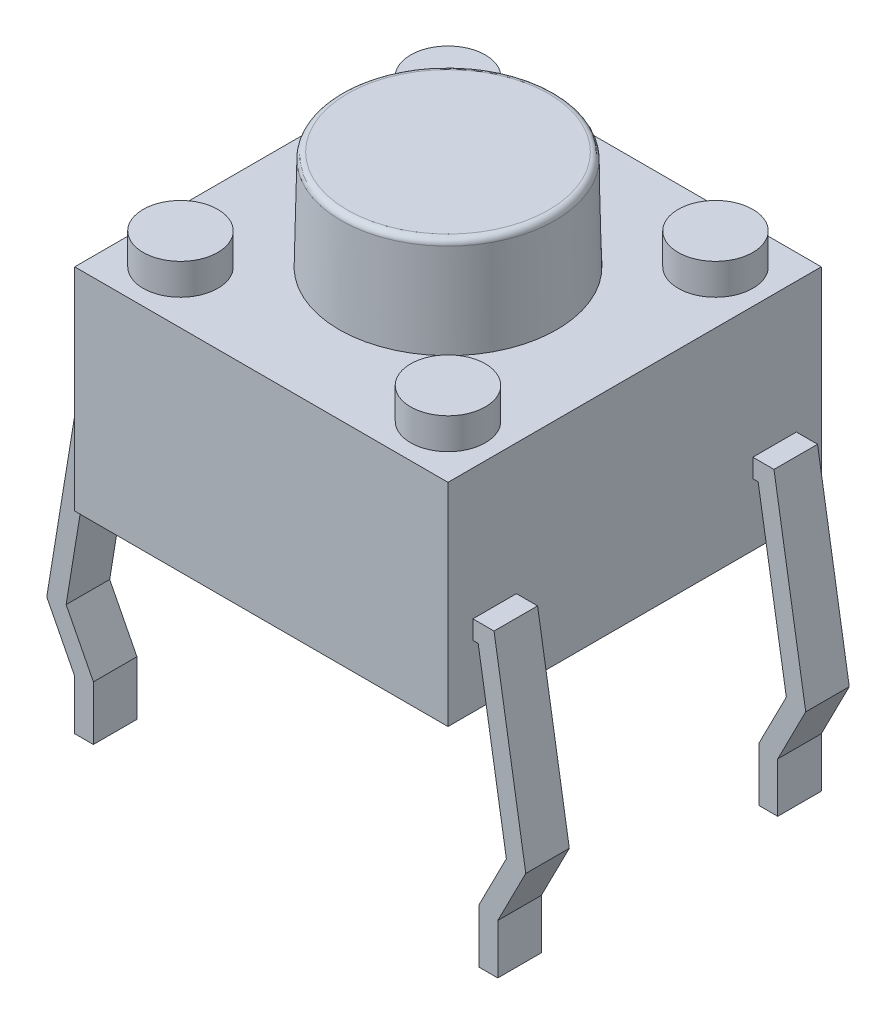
ISO-10303-21;
HEADER;
FILE_DESCRIPTION(('STEP AP214'),'2;1');
FILE_NAME('part.step','',(''),(''),'','','');
FILE_SCHEMA(('AUTOMOTIVE_DESIGN { 1 0 10303 214 1 1 1 1 }'));
ENDSEC;
DATA;
#1=APPLICATION_CONTEXT('core data for automotive mechanical design processes');
#2=APPLICATION_PROTOCOL_DEFINITION('international standard','automotive_design',2000,#1);
#3=PRODUCT_CONTEXT('',#1,'mechanical');
#4=PRODUCT('Part','Part','',(#3));
#5=PRODUCT_RELATED_PRODUCT_CATEGORY('part','',(#4));
#6=PRODUCT_DEFINITION_FORMATION('','',#4);
#7=PRODUCT_DEFINITION_CONTEXT('part definition',#1,'design');
#8=PRODUCT_DEFINITION('design','',#6,#7);
#9=PRODUCT_DEFINITION_SHAPE('','',#8);
#10=(LENGTH_UNIT() NAMED_UNIT(*) SI_UNIT(.MILLI.,.METRE.));
#11=(NAMED_UNIT(*) PLANE_ANGLE_UNIT() SI_UNIT($,.RADIAN.));
#12=(NAMED_UNIT(*) SI_UNIT($,.STERADIAN.) SOLID_ANGLE_UNIT());
#13=UNCERTAINTY_MEASURE_WITH_UNIT(LENGTH_MEASURE(1.E-05),#10,'distance_accuracy_value','');
#14=(GEOMETRIC_REPRESENTATION_CONTEXT(3) GLOBAL_UNCERTAINTY_ASSIGNED_CONTEXT((#13)) GLOBAL_UNIT_ASSIGNED_CONTEXT((#10,
#11,#12)) REPRESENTATION_CONTEXT('',''));
#15=CARTESIAN_POINT('',(0.,0.,0.));
#16=DIRECTION('',(0.,0.,1.));
#17=DIRECTION('',(1.,0.,0.));
#18=AXIS2_PLACEMENT_3D('',#15,#16,#17);
#19=CARTESIAN_POINT('',(0.,2.,0.));
#20=DIRECTION('',(0.,-1.,0.));
#21=DIRECTION('',(0.,0.,-1.));
#22=AXIS2_PLACEMENT_3D('',#19,#20,#21);
#23=PLANE('',#22);
#24=DIRECTION('',(-1.,0.,0.));
#25=VECTOR('',#24,1.);
#26=CARTESIAN_POINT('',(-13.5850569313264,2.,-18.5));
#27=LINE('',#26,#25);
#28=CARTESIAN_POINT('',(-13.5,2.,-18.5));
#29=VERTEX_POINT('',#28);
#30=CARTESIAN_POINT('',(-13.5850569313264,2.,-18.5));
#31=VERTEX_POINT('',#30);
#32=EDGE_CURVE('P0_E353',#29,#31,#27,.T.);
#33=ORIENTED_EDGE('',*,*,#32,.F.);
#34=DIRECTION('',(0.,0.,-1.));
#35=VECTOR('',#34,1.);
#36=CARTESIAN_POINT('',(-13.5,2.,-18.9));
#37=LINE('',#36,#35);
#38=CARTESIAN_POINT('',(-13.5,2.,-17.8));
#39=VERTEX_POINT('',#38);
#40=EDGE_CURVE('P0_E685',#39,#29,#37,.T.);
#41=ORIENTED_EDGE('',*,*,#40,.F.);
#42=DIRECTION('',(-1.,0.,0.));
#43=VECTOR('',#42,1.);
#44=CARTESIAN_POINT('',(-13.5,2.,-17.8));
#45=LINE('',#44,#43);
#46=CARTESIAN_POINT('',(-13.5850569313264,2.,-17.8));
#47=VERTEX_POINT('',#46);
#48=EDGE_CURVE('P0_E580',#39,#47,#45,.T.);
#49=ORIENTED_EDGE('',*,*,#48,.T.);
#50=DIRECTION('',(0.,0.,1.));
#51=VECTOR('',#50,1.);
#52=CARTESIAN_POINT('',(-13.5850569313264,2.,-18.5));
#53=LINE('',#52,#51);
#54=EDGE_CURVE('P0_E403',#31,#47,#53,.T.);
#55=ORIENTED_EDGE('',*,*,#54,.F.);
#56=EDGE_LOOP('',(#33,#41,#49,#55));
#57=FACE_BOUND('',#56,.T.);
#58=ADVANCED_FACE('P0_F39',(#57),#23,.T.);
#59=DIRECTION('',(-1.,0.,0.));
#60=VECTOR('',#59,1.);
#61=CARTESIAN_POINT('',(-13.5,2.,-14.));
#62=LINE('',#61,#60);
#63=CARTESIAN_POINT('',(-13.5,2.,-14.));
#64=VERTEX_POINT('',#63);
#65=CARTESIAN_POINT('',(-13.5850569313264,2.,-14.));
#66=VERTEX_POINT('',#65);
#67=EDGE_CURVE('P0_E578',#64,#66,#62,.T.);
#68=ORIENTED_EDGE('',*,*,#67,.F.);
#69=CARTESIAN_POINT('',(-13.5,2.,-13.3));
#70=VERTEX_POINT('',#69);
#71=EDGE_CURVE('P0_E695',#70,#64,#37,.T.);
#72=ORIENTED_EDGE('',*,*,#71,.F.);
#73=DIRECTION('',(-1.,0.,0.));
#74=VECTOR('',#73,1.);
#75=CARTESIAN_POINT('',(-13.5,2.,-13.3));
#76=LINE('',#75,#74);
#77=CARTESIAN_POINT('',(-13.5850569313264,2.,-13.3));
#78=VERTEX_POINT('',#77);
#79=EDGE_CURVE('P0_E572',#70,#78,#76,.T.);
#80=ORIENTED_EDGE('',*,*,#79,.T.);
#81=DIRECTION('',(0.,0.,-1.));
#82=VECTOR('',#81,1.);
#83=CARTESIAN_POINT('',(-13.5850569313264,2.,-13.3));
#84=LINE('',#83,#82);
#85=EDGE_CURVE('P0_E470',#78,#66,#84,.T.);
#86=ORIENTED_EDGE('',*,*,#85,.T.);
#87=EDGE_LOOP('',(#68,#72,#80,#86));
#88=FACE_BOUND('',#87,.T.);
#89=ADVANCED_FACE('P0_F708',(#88),#23,.T.);
#90=DIRECTION('',(1.,0.,0.));
#91=VECTOR('',#90,1.);
#92=CARTESIAN_POINT('',(-7.49999999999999,2.,-13.3));
#93=LINE('',#92,#91);
#94=CARTESIAN_POINT('',(-7.49999999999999,2.,-13.3));
#95=VERTEX_POINT('',#94);
#96=CARTESIAN_POINT('',(-7.41494306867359,2.,-13.3));
#97=VERTEX_POINT('',#96);
#98=EDGE_CURVE('P0_E527',#95,#97,#93,.T.);
#99=ORIENTED_EDGE('',*,*,#98,.F.);
#100=DIRECTION('',(0.,0.,1.));
#101=VECTOR('',#100,1.);
#102=CARTESIAN_POINT('',(-7.49999999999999,2.,-12.9));
#103=LINE('',#102,#101);
#104=CARTESIAN_POINT('',(-7.49999999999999,2.,-14.));
#105=VERTEX_POINT('',#104);
#106=EDGE_CURVE('P0_E535',#105,#95,#103,.T.);
#107=ORIENTED_EDGE('',*,*,#106,.F.);
#108=DIRECTION('',(1.,0.,0.));
#109=VECTOR('',#108,1.);
#110=CARTESIAN_POINT('',(-7.49999999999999,2.,-14.));
#111=LINE('',#110,#109);
#112=CARTESIAN_POINT('',(-7.41494306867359,2.,-14.));
#113=VERTEX_POINT('',#112);
#114=EDGE_CURVE('P0_E509',#105,#113,#111,.T.);
#115=ORIENTED_EDGE('',*,*,#114,.T.);
#116=DIRECTION('',(0.,0.,-1.));
#117=VECTOR('',#116,1.);
#118=CARTESIAN_POINT('',(-7.41494306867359,2.,-13.3));
#119=LINE('',#118,#117);
#120=EDGE_CURVE('P0_E445',#97,#113,#119,.T.);
#121=ORIENTED_EDGE('',*,*,#120,.F.);
#122=EDGE_LOOP('',(#99,#107,#115,#121));
#123=FACE_BOUND('',#122,.T.);
#124=ADVANCED_FACE('P0_F534',(#123),#23,.T.);
#125=DIRECTION('',(1.,0.,0.));
#126=VECTOR('',#125,1.);
#127=CARTESIAN_POINT('',(-7.49999999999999,2.,-17.8));
#128=LINE('',#127,#126);
#129=CARTESIAN_POINT('',(-7.49999999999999,2.,-17.8));
#130=VERTEX_POINT('',#129);
#131=CARTESIAN_POINT('',(-7.41494306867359,2.,-17.8));
#132=VERTEX_POINT('',#131);
#133=EDGE_CURVE('P0_E536',#130,#132,#128,.T.);
#134=ORIENTED_EDGE('',*,*,#133,.F.);
#135=CARTESIAN_POINT('',(-7.49999999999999,2.,-18.5));
#136=VERTEX_POINT('',#135);
#137=EDGE_CURVE('P0_E688',#136,#130,#103,.T.);
#138=ORIENTED_EDGE('',*,*,#137,.F.);
#139=CARTESIAN_POINT('',(-7.41494306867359,2.,-18.5));
#140=VERTEX_POINT('',#139);
#141=EDGE_CURVE('P0_E354',#140,#136,#27,.T.);
#142=ORIENTED_EDGE('',*,*,#141,.F.);
#143=DIRECTION('',(0.,0.,1.));
#144=VECTOR('',#143,1.);
#145=CARTESIAN_POINT('',(-7.41494306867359,2.,-18.5));
#146=LINE('',#145,#144);
#147=EDGE_CURVE('P0_E406',#140,#132,#146,.T.);
#148=ORIENTED_EDGE('',*,*,#147,.T.);
#149=EDGE_LOOP('',(#134,#138,#142,#148));
#150=FACE_BOUND('',#149,.T.);
#151=ADVANCED_FACE('P0_F761',(#150),#23,.T.);
#152=CARTESIAN_POINT('',(0.,0.,-18.5));
#153=DIRECTION('',(0.,0.,1.));
#154=DIRECTION('',(1.,0.,0.));
#155=AXIS2_PLACEMENT_3D('',#152,#153,#154);
#156=PLANE('',#155);
#157=DIRECTION('',(0.161320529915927,-0.98690206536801,0.));
#158=VECTOR('',#157,1.);
#159=CARTESIAN_POINT('',(-6.3753846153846,-2.5,-18.5));
#160=LINE('',#159,#158);
#161=CARTESIAN_POINT('',(-7.15999999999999,2.3,-18.5));
#162=VERTEX_POINT('',#161);
#163=CARTESIAN_POINT('',(-6.64999999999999,-0.820000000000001,-18.5));
#164=VERTEX_POINT('',#163);
#165=EDGE_CURVE('P0_E342',#162,#164,#160,.T.);
#166=ORIENTED_EDGE('',*,*,#165,.T.);
#167=DIRECTION('',(0.455289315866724,0.890343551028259,0.));
#168=VECTOR('',#167,1.);
#169=CARTESIAN_POINT('',(-7.09999999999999,-1.7,-18.5));
#170=LINE('',#169,#168);
#171=CARTESIAN_POINT('',(-7.09999999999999,-1.7,-18.5));
#172=VERTEX_POINT('',#171);
#173=EDGE_CURVE('P0_E328',#172,#164,#170,.T.);
#174=ORIENTED_EDGE('',*,*,#173,.F.);
#175=DIRECTION('',(0.,1.,0.));
#176=VECTOR('',#175,1.);
#177=CARTESIAN_POINT('',(-7.09999999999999,-2.5,-18.5));
#178=LINE('',#177,#176);
#179=CARTESIAN_POINT('',(-7.09999999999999,-2.5,-18.5));
#180=VERTEX_POINT('',#179);
#181=EDGE_CURVE('P0_E322',#180,#172,#178,.T.);
#182=ORIENTED_EDGE('',*,*,#181,.F.);
#183=DIRECTION('',(-1.,0.,0.));
#184=VECTOR('',#183,1.);
#185=CARTESIAN_POINT('',(-7.39999999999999,-2.5,-18.5));
#186=LINE('',#185,#184);
#187=CARTESIAN_POINT('',(-7.39999999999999,-2.5,-18.5));
#188=VERTEX_POINT('',#187);
#189=EDGE_CURVE('P0_E333',#180,#188,#186,.T.);
#190=ORIENTED_EDGE('',*,*,#189,.T.);
#191=DIRECTION('',(0.,1.,0.));
#192=VECTOR('',#191,1.);
#193=CARTESIAN_POINT('',(-7.39999999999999,-1.62774498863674,-18.5));
#194=LINE('',#193,#192);
#195=CARTESIAN_POINT('',(-7.39999999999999,-1.62774498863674,-18.5));
#196=VERTEX_POINT('',#195);
#197=EDGE_CURVE('P0_E341',#188,#196,#194,.T.);
#198=ORIENTED_EDGE('',*,*,#197,.T.);
#199=DIRECTION('',(0.455289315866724,0.890343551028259,0.));
#200=VECTOR('',#199,1.);
#201=CARTESIAN_POINT('',(-6.96196707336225,-0.771147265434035,-18.5));
#202=LINE('',#201,#200);
#203=CARTESIAN_POINT('',(-6.96196707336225,-0.771147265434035,-18.5));
#204=VERTEX_POINT('',#203);
#205=EDGE_CURVE('P0_E344',#196,#204,#202,.T.);
#206=ORIENTED_EDGE('',*,*,#205,.T.);
#207=DIRECTION('',(-0.161320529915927,0.98690206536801,0.));
#208=VECTOR('',#207,1.);
#209=CARTESIAN_POINT('',(-7.41494306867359,2.,-18.5));
#210=LINE('',#209,#208);
#211=EDGE_CURVE('P0_E351',#204,#140,#210,.T.);
#212=ORIENTED_EDGE('',*,*,#211,.T.);
#213=ORIENTED_EDGE('',*,*,#141,.T.);
#214=DIRECTION('',(0.,-1.,0.));
#215=VECTOR('',#214,1.);
#216=CARTESIAN_POINT('',(-7.49999999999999,2.,-18.5));
#217=LINE('',#216,#215);
#218=CARTESIAN_POINT('',(-7.49999999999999,2.3,-18.5));
#219=VERTEX_POINT('',#218);
#220=EDGE_CURVE('P0_E11',#219,#136,#217,.T.);
#221=ORIENTED_EDGE('',*,*,#220,.F.);
#222=DIRECTION('',(1.,0.,0.));
#223=VECTOR('',#222,1.);
#224=CARTESIAN_POINT('',(-7.49999999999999,2.3,-18.5));
#225=LINE('',#224,#223);
#226=EDGE_CURVE('P0_E532',#219,#162,#225,.T.);
#227=ORIENTED_EDGE('',*,*,#226,.T.);
#228=EDGE_LOOP('',(#166,#174,#182,#190,#198,#206,#212,#213,#221,#227));
#229=FACE_BOUND('',#228,.T.);
#230=ADVANCED_FACE('P0_F332',(#229),#156,.F.);
#231=DIRECTION('',(-1.,0.,0.));
#232=VECTOR('',#231,1.);
#233=CARTESIAN_POINT('',(-14.6246153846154,-2.5,-18.5));
#234=LINE('',#233,#232);
#235=CARTESIAN_POINT('',(-13.6,-2.5,-18.5));
#236=VERTEX_POINT('',#235);
#237=CARTESIAN_POINT('',(-13.9,-2.5,-18.5));
#238=VERTEX_POINT('',#237);
#239=EDGE_CURVE('P0_E363',#236,#238,#234,.T.);
#240=ORIENTED_EDGE('',*,*,#239,.T.);
#241=DIRECTION('',(0.,-1.,0.));
#242=VECTOR('',#241,1.);
#243=CARTESIAN_POINT('',(-13.9,-1.7,-18.5));
#244=LINE('',#243,#242);
#245=CARTESIAN_POINT('',(-13.9,-1.7,-18.5));
#246=VERTEX_POINT('',#245);
#247=EDGE_CURVE('P0_E660',#246,#238,#244,.T.);
#248=ORIENTED_EDGE('',*,*,#247,.F.);
#249=DIRECTION('',(0.455289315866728,-0.890343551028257,0.));
#250=VECTOR('',#249,1.);
#251=CARTESIAN_POINT('',(-14.35,-0.819999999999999,-18.5));
#252=LINE('',#251,#250);
#253=CARTESIAN_POINT('',(-14.35,-0.819999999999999,-18.5));
#254=VERTEX_POINT('',#253);
#255=EDGE_CURVE('P0_E657',#254,#246,#252,.T.);
#256=ORIENTED_EDGE('',*,*,#255,.F.);
#257=DIRECTION('',(0.161320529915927,0.98690206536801,0.));
#258=VECTOR('',#257,1.);
#259=CARTESIAN_POINT('',(-13.84,2.3,-18.5));
#260=LINE('',#259,#258);
#261=CARTESIAN_POINT('',(-13.84,2.3,-18.5));
#262=VERTEX_POINT('',#261);
#263=EDGE_CURVE('P0_E366',#254,#262,#260,.T.);
#264=ORIENTED_EDGE('',*,*,#263,.T.);
#265=DIRECTION('',(-1.,0.,0.));
#266=VECTOR('',#265,1.);
#267=CARTESIAN_POINT('',(-13.5,2.3,-18.5));
#268=LINE('',#267,#266);
#269=CARTESIAN_POINT('',(-13.5,2.3,-18.5));
#270=VERTEX_POINT('',#269);
#271=EDGE_CURVE('P0_E571',#270,#262,#268,.T.);
#272=ORIENTED_EDGE('',*,*,#271,.F.);
#273=DIRECTION('',(0.,1.,0.));
#274=VECTOR('',#273,1.);
#275=CARTESIAN_POINT('',(-13.5,4.4,-18.5));
#276=LINE('',#275,#274);
#277=EDGE_CURVE('P0_E614',#29,#270,#276,.T.);
#278=ORIENTED_EDGE('',*,*,#277,.F.);
#279=ORIENTED_EDGE('',*,*,#32,.T.);
#280=DIRECTION('',(-0.161320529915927,-0.98690206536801,0.));
#281=VECTOR('',#280,1.);
#282=CARTESIAN_POINT('',(-14.0380329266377,-0.771147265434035,-18.5));
#283=LINE('',#282,#281);
#284=CARTESIAN_POINT('',(-14.0380329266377,-0.771147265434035,-18.5));
#285=VERTEX_POINT('',#284);
#286=EDGE_CURVE('P0_E357',#31,#285,#283,.T.);
#287=ORIENTED_EDGE('',*,*,#286,.T.);
#288=DIRECTION('',(0.455289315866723,-0.89034355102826,0.));
#289=VECTOR('',#288,1.);
#290=CARTESIAN_POINT('',(-13.6,-1.62774498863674,-18.5));
#291=LINE('',#290,#289);
#292=CARTESIAN_POINT('',(-13.6,-1.62774498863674,-18.5));
#293=VERTEX_POINT('',#292);
#294=EDGE_CURVE('P0_E359',#285,#293,#291,.T.);
#295=ORIENTED_EDGE('',*,*,#294,.T.);
#296=DIRECTION('',(0.,-1.,0.));
#297=VECTOR('',#296,1.);
#298=CARTESIAN_POINT('',(-13.6,-2.5,-18.5));
#299=LINE('',#298,#297);
#300=EDGE_CURVE('P0_E361',#293,#236,#299,.T.);
#301=ORIENTED_EDGE('',*,*,#300,.T.);
#302=EDGE_LOOP('',(#240,#248,#256,#264,#272,#278,#279,#287,#295,#301));
#303=FACE_BOUND('',#302,.T.);
#304=ADVANCED_FACE('P0_F772',(#303),#156,.F.);
#305=CARTESIAN_POINT('',(0.,4.4,0.));
#306=DIRECTION('',(0.,-1.,0.));
#307=DIRECTION('',(0.,0.,-1.));
#308=AXIS2_PLACEMENT_3D('',#305,#306,#307);
#309=PLANE('',#308);
#310=CARTESIAN_POINT('',(-10.5,4.4,-15.9));
#311=DIRECTION('',(0.,1.,0.));
#312=DIRECTION('',(0.,0.,1.));
#313=AXIS2_PLACEMENT_3D('',#310,#311,#312);
#314=CIRCLE('',#313,1.74999999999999);
#315=CARTESIAN_POINT('',(-10.5,4.4,-14.15));
#316=VERTEX_POINT('',#315);
#317=EDGE_CURVE('P0_E1553',#316,#316,#314,.T.);
#318=ORIENTED_EDGE('',*,*,#317,.F.);
#319=EDGE_LOOP('',(#318));
#320=FACE_BOUND('',#319,.T.);
#321=CARTESIAN_POINT('',(-8.34999999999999,4.4,-13.75));
#322=DIRECTION('',(0.,-1.,0.));
#323=DIRECTION('',(0.,0.,-1.));
#324=AXIS2_PLACEMENT_3D('',#321,#322,#323);
#325=CIRCLE('',#324,0.6);
#326=CARTESIAN_POINT('',(-8.34999999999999,4.4,-14.35));
#327=VERTEX_POINT('',#326);
#328=EDGE_CURVE('P0_E1555',#327,#327,#325,.T.);
#329=ORIENTED_EDGE('',*,*,#328,.T.);
#330=EDGE_LOOP('',(#329));
#331=FACE_BOUND('',#330,.T.);
#332=CARTESIAN_POINT('',(-12.65,4.4,-18.05));
#333=DIRECTION('',(0.,-1.,0.));
#334=DIRECTION('',(0.,0.,-1.));
#335=AXIS2_PLACEMENT_3D('',#332,#333,#334);
#336=CIRCLE('',#335,0.6);
#337=CARTESIAN_POINT('',(-12.65,4.4,-18.65));
#338=VERTEX_POINT('',#337);
#339=EDGE_CURVE('P0_E1563',#338,#338,#336,.T.);
#340=ORIENTED_EDGE('',*,*,#339,.T.);
#341=EDGE_LOOP('',(#340));
#342=FACE_BOUND('',#341,.T.);
#343=CARTESIAN_POINT('',(-12.65,4.4,-13.75));
#344=DIRECTION('',(0.,-1.,0.));
#345=DIRECTION('',(0.,0.,-1.));
#346=AXIS2_PLACEMENT_3D('',#343,#344,#345);
#347=CIRCLE('',#346,0.6);
#348=CARTESIAN_POINT('',(-12.65,4.4,-14.35));
#349=VERTEX_POINT('',#348);
#350=EDGE_CURVE('P0_E1569',#349,#349,#347,.T.);
#351=ORIENTED_EDGE('',*,*,#350,.T.);
#352=EDGE_LOOP('',(#351));
#353=FACE_BOUND('',#352,.T.);
#354=CARTESIAN_POINT('',(-8.34999999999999,4.4,-18.05));
#355=DIRECTION('',(0.,-1.,0.));
#356=DIRECTION('',(0.,0.,-1.));
#357=AXIS2_PLACEMENT_3D('',#354,#355,#356);
#358=CIRCLE('',#357,0.6);
#359=CARTESIAN_POINT('',(-8.34999999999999,4.4,-18.65));
#360=VERTEX_POINT('',#359);
#361=EDGE_CURVE('P0_E1575',#360,#360,#358,.T.);
#362=ORIENTED_EDGE('',*,*,#361,.T.);
#363=EDGE_LOOP('',(#362));
#364=FACE_BOUND('',#363,.T.);
#365=DIRECTION('',(-1.,0.,0.));
#366=VECTOR('',#365,1.);
#367=CARTESIAN_POINT('',(-13.84,4.4,-12.9));
#368=LINE('',#367,#366);
#369=CARTESIAN_POINT('',(-7.49999999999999,4.4,-12.9));
#370=VERTEX_POINT('',#369);
#371=CARTESIAN_POINT('',(-13.5,4.4,-12.9));
#372=VERTEX_POINT('',#371);
#373=EDGE_CURVE('P0_E373',#370,#372,#368,.T.);
#374=ORIENTED_EDGE('',*,*,#373,.F.);
#375=DIRECTION('',(0.,0.,1.));
#376=VECTOR('',#375,1.);
#377=CARTESIAN_POINT('',(-7.49999999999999,4.4,-18.5));
#378=LINE('',#377,#376);
#379=CARTESIAN_POINT('',(-7.49999999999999,4.4,-18.9));
#380=VERTEX_POINT('',#379);
#381=EDGE_CURVE('P0_E606',#380,#370,#378,.T.);
#382=ORIENTED_EDGE('',*,*,#381,.F.);
#383=DIRECTION('',(1.,0.,0.));
#384=VECTOR('',#383,1.);
#385=CARTESIAN_POINT('',(-7.49999999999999,4.4,-18.9));
#386=LINE('',#385,#384);
#387=CARTESIAN_POINT('',(-13.5,4.4,-18.9));
#388=VERTEX_POINT('',#387);
#389=EDGE_CURVE('P0_E605',#388,#380,#386,.T.);
#390=ORIENTED_EDGE('',*,*,#389,.F.);
#391=DIRECTION('',(0.,0.,-1.));
#392=VECTOR('',#391,1.);
#393=CARTESIAN_POINT('',(-13.5,4.4,-12.9));
#394=LINE('',#393,#392);
#395=EDGE_CURVE('P0_E554',#372,#388,#394,.T.);
#396=ORIENTED_EDGE('',*,*,#395,.F.);
#397=EDGE_LOOP('',(#374,#382,#390,#396));
#398=FACE_BOUND('',#397,.T.);
#399=ADVANCED_FACE('P0_F603',(#320,#331,#342,#353,#364,#398),#309,.F.);
#400=CARTESIAN_POINT('',(0.,0.,-12.9));
#401=DIRECTION('',(0.,0.,-1.));
#402=DIRECTION('',(-1.,0.,0.));
#403=AXIS2_PLACEMENT_3D('',#400,#401,#402);
#404=PLANE('',#403);
#405=DIRECTION('',(0.,1.,0.));
#406=VECTOR('',#405,1.);
#407=CARTESIAN_POINT('',(-13.5,2.,-12.9));
#408=LINE('',#407,#406);
#409=CARTESIAN_POINT('',(-13.5,1.,-12.9));
#410=VERTEX_POINT('',#409);
#411=EDGE_CURVE('P0_E539',#410,#372,#408,.T.);
#412=ORIENTED_EDGE('',*,*,#411,.F.);
#413=DIRECTION('',(-1.,0.,0.));
#414=VECTOR('',#413,1.);
#415=CARTESIAN_POINT('',(-13.5,1.,-12.9));
#416=LINE('',#415,#414);
#417=CARTESIAN_POINT('',(-7.49999999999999,1.,-12.9));
#418=VERTEX_POINT('',#417);
#419=EDGE_CURVE('P0_E686',#418,#410,#416,.T.);
#420=ORIENTED_EDGE('',*,*,#419,.F.);
#421=DIRECTION('',(0.,-1.,0.));
#422=VECTOR('',#421,1.);
#423=CARTESIAN_POINT('',(-7.49999999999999,4.4,-12.9));
#424=LINE('',#423,#422);
#425=EDGE_CURVE('P0_E592',#370,#418,#424,.T.);
#426=ORIENTED_EDGE('',*,*,#425,.F.);
#427=ORIENTED_EDGE('',*,*,#373,.T.);
#428=EDGE_LOOP('',(#412,#420,#426,#427));
#429=FACE_BOUND('',#428,.T.);
#430=ADVANCED_FACE('P0_F589',(#429),#404,.F.);
#431=CARTESIAN_POINT('',(0.,0.,-13.3));
#432=DIRECTION('',(0.,0.,1.));
#433=DIRECTION('',(1.,0.,0.));
#434=AXIS2_PLACEMENT_3D('',#431,#432,#433);
#435=PLANE('',#434);
#436=DIRECTION('',(0.,-1.,0.));
#437=VECTOR('',#436,1.);
#438=CARTESIAN_POINT('',(-7.09999999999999,-1.7,-13.3));
#439=LINE('',#438,#437);
#440=CARTESIAN_POINT('',(-7.09999999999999,-1.7,-13.3));
#441=VERTEX_POINT('',#440);
#442=CARTESIAN_POINT('',(-7.09999999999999,-2.5,-13.3));
#443=VERTEX_POINT('',#442);
#444=EDGE_CURVE('P0_E524',#441,#443,#439,.T.);
#445=ORIENTED_EDGE('',*,*,#444,.F.);
#446=DIRECTION('',(-0.455289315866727,-0.890343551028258,0.));
#447=VECTOR('',#446,1.);
#448=CARTESIAN_POINT('',(-6.64999999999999,-0.819999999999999,-13.3));
#449=LINE('',#448,#447);
#450=CARTESIAN_POINT('',(-6.64999999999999,-0.819999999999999,-13.3));
#451=VERTEX_POINT('',#450);
#452=EDGE_CURVE('P0_E646',#451,#441,#449,.T.);
#453=ORIENTED_EDGE('',*,*,#452,.F.);
#454=DIRECTION('',(-0.161320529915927,0.98690206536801,0.));
#455=VECTOR('',#454,1.);
#456=CARTESIAN_POINT('',(-7.15999999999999,2.3,-13.3));
#457=LINE('',#456,#455);
#458=CARTESIAN_POINT('',(-7.15999999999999,2.3,-13.3));
#459=VERTEX_POINT('',#458);
#460=EDGE_CURVE('P0_E431',#451,#459,#457,.T.);
#461=ORIENTED_EDGE('',*,*,#460,.T.);
#462=DIRECTION('',(1.,0.,0.));
#463=VECTOR('',#462,1.);
#464=CARTESIAN_POINT('',(-7.49999999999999,2.3,-13.3));
#465=LINE('',#464,#463);
#466=CARTESIAN_POINT('',(-7.49999999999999,2.3,-13.3));
#467=VERTEX_POINT('',#466);
#468=EDGE_CURVE('P0_E531',#467,#459,#465,.T.);
#469=ORIENTED_EDGE('',*,*,#468,.F.);
#470=DIRECTION('',(0.,1.,0.));
#471=VECTOR('',#470,1.);
#472=CARTESIAN_POINT('',(-7.49999999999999,2.,-13.3));
#473=LINE('',#472,#471);
#474=EDGE_CURVE('P0_E529',#95,#467,#473,.T.);
#475=ORIENTED_EDGE('',*,*,#474,.F.);
#476=ORIENTED_EDGE('',*,*,#98,.T.);
#477=DIRECTION('',(0.161320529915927,-0.98690206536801,0.));
#478=VECTOR('',#477,1.);
#479=CARTESIAN_POINT('',(-6.96196707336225,-0.771147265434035,-13.3));
#480=LINE('',#479,#478);
#481=CARTESIAN_POINT('',(-6.96196707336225,-0.771147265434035,-13.3));
#482=VERTEX_POINT('',#481);
#483=EDGE_CURVE('P0_E420',#97,#482,#480,.T.);
#484=ORIENTED_EDGE('',*,*,#483,.T.);
#485=DIRECTION('',(-0.455289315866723,-0.89034355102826,0.));
#486=VECTOR('',#485,1.);
#487=CARTESIAN_POINT('',(-7.39999999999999,-1.62774498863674,-13.3));
#488=LINE('',#487,#486);
#489=CARTESIAN_POINT('',(-7.39999999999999,-1.62774498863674,-13.3));
#490=VERTEX_POINT('',#489);
#491=EDGE_CURVE('P0_E423',#482,#490,#488,.T.);
#492=ORIENTED_EDGE('',*,*,#491,.T.);
#493=DIRECTION('',(0.,-1.,0.));
#494=VECTOR('',#493,1.);
#495=CARTESIAN_POINT('',(-7.39999999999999,-2.5,-13.3));
#496=LINE('',#495,#494);
#497=CARTESIAN_POINT('',(-7.39999999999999,-2.5,-13.3));
#498=VERTEX_POINT('',#497);
#499=EDGE_CURVE('P0_E426',#490,#498,#496,.T.);
#500=ORIENTED_EDGE('',*,*,#499,.T.);
#501=DIRECTION('',(1.,0.,0.));
#502=VECTOR('',#501,1.);
#503=CARTESIAN_POINT('',(-6.3753846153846,-2.5,-13.3));
#504=LINE('',#503,#502);
#505=EDGE_CURVE('P0_E428',#498,#443,#504,.T.);
#506=ORIENTED_EDGE('',*,*,#505,.T.);
#507=EDGE_LOOP('',(#445,#453,#461,#469,#475,#476,#484,#492,#500,#506));
#508=FACE_BOUND('',#507,.T.);
#509=ADVANCED_FACE('P0_F522',(#508),#435,.T.);
#510=CARTESIAN_POINT('',(0.,0.,-14.));
#511=DIRECTION('',(0.,0.,1.));
#512=DIRECTION('',(1.,0.,0.));
#513=AXIS2_PLACEMENT_3D('',#510,#511,#512);
#514=PLANE('',#513);
#515=DIRECTION('',(0.455289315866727,0.890343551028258,0.));
#516=VECTOR('',#515,1.);
#517=CARTESIAN_POINT('',(-6.64999999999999,-0.819999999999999,-14.));
#518=LINE('',#517,#516);
#519=CARTESIAN_POINT('',(-7.09999999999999,-1.7,-14.));
#520=VERTEX_POINT('',#519);
#521=CARTESIAN_POINT('',(-6.64999999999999,-0.819999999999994,-14.));
#522=VERTEX_POINT('',#521);
#523=EDGE_CURVE('P0_E62',#520,#522,#518,.T.);
#524=ORIENTED_EDGE('',*,*,#523,.F.);
#525=DIRECTION('',(0.,1.,0.));
#526=VECTOR('',#525,1.);
#527=CARTESIAN_POINT('',(-7.09999999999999,-1.7,-14.));
#528=LINE('',#527,#526);
#529=CARTESIAN_POINT('',(-7.09999999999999,-2.5,-14.));
#530=VERTEX_POINT('',#529);
#531=EDGE_CURVE('P0_E806',#530,#520,#528,.T.);
#532=ORIENTED_EDGE('',*,*,#531,.F.);
#533=DIRECTION('',(1.,0.,0.));
#534=VECTOR('',#533,1.);
#535=CARTESIAN_POINT('',(-6.3753846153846,-2.5,-14.));
#536=LINE('',#535,#534);
#537=CARTESIAN_POINT('',(-7.39999999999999,-2.5,-14.));
#538=VERTEX_POINT('',#537);
#539=EDGE_CURVE('P0_E452',#538,#530,#536,.T.);
#540=ORIENTED_EDGE('',*,*,#539,.F.);
#541=DIRECTION('',(0.,-1.,0.));
#542=VECTOR('',#541,1.);
#543=CARTESIAN_POINT('',(-7.39999999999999,-2.5,-14.));
#544=LINE('',#543,#542);
#545=CARTESIAN_POINT('',(-7.39999999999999,-1.62774498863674,-14.));
#546=VERTEX_POINT('',#545);
#547=EDGE_CURVE('P0_E450',#546,#538,#544,.T.);
#548=ORIENTED_EDGE('',*,*,#547,.F.);
#549=DIRECTION('',(-0.455289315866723,-0.89034355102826,0.));
#550=VECTOR('',#549,1.);
#551=CARTESIAN_POINT('',(-7.39999999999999,-1.62774498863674,-14.));
#552=LINE('',#551,#550);
#553=CARTESIAN_POINT('',(-6.96196707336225,-0.771147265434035,-14.));
#554=VERTEX_POINT('',#553);
#555=EDGE_CURVE('P0_E448',#554,#546,#552,.T.);
#556=ORIENTED_EDGE('',*,*,#555,.F.);
#557=DIRECTION('',(0.161320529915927,-0.98690206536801,0.));
#558=VECTOR('',#557,1.);
#559=CARTESIAN_POINT('',(-6.96196707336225,-0.771147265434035,-14.));
#560=LINE('',#559,#558);
#561=EDGE_CURVE('P0_E419',#113,#554,#560,.T.);
#562=ORIENTED_EDGE('',*,*,#561,.F.);
#563=ORIENTED_EDGE('',*,*,#114,.F.);
#564=DIRECTION('',(0.,-1.,0.));
#565=VECTOR('',#564,1.);
#566=CARTESIAN_POINT('',(-7.49999999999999,2.3,-14.));
#567=LINE('',#566,#565);
#568=CARTESIAN_POINT('',(-7.49999999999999,2.3,-14.));
#569=VERTEX_POINT('',#568);
#570=EDGE_CURVE('P0_E551',#569,#105,#567,.T.);
#571=ORIENTED_EDGE('',*,*,#570,.F.);
#572=DIRECTION('',(1.,0.,0.));
#573=VECTOR('',#572,1.);
#574=CARTESIAN_POINT('',(-7.49999999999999,2.3,-14.));
#575=LINE('',#574,#573);
#576=CARTESIAN_POINT('',(-7.15999999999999,2.3,-14.));
#577=VERTEX_POINT('',#576);
#578=EDGE_CURVE('P0_E537',#569,#577,#575,.T.);
#579=ORIENTED_EDGE('',*,*,#578,.T.);
#580=DIRECTION('',(-0.161320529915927,0.98690206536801,0.));
#581=VECTOR('',#580,1.);
#582=CARTESIAN_POINT('',(-7.15999999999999,2.3,-14.));
#583=LINE('',#582,#581);
#584=EDGE_CURVE('P0_E455',#522,#577,#583,.T.);
#585=ORIENTED_EDGE('',*,*,#584,.F.);
#586=EDGE_LOOP('',(#524,#532,#540,#548,#556,#562,#563,#571,#579,#585));
#587=FACE_BOUND('',#586,.T.);
#588=ADVANCED_FACE('P0_F507',(#587),#514,.F.);
#589=CARTESIAN_POINT('',(-6.96196707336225,-0.771147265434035,-13.3));
#590=DIRECTION('',(0.98690206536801,0.161320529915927,0.));
#591=DIRECTION('',(-0.161320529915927,0.98690206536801,0.));
#592=AXIS2_PLACEMENT_3D('',#589,#590,#591);
#593=PLANE('',#592);
#594=ORIENTED_EDGE('',*,*,#561,.T.);
#595=DIRECTION('',(0.,0.,-1.));
#596=VECTOR('',#595,1.);
#597=CARTESIAN_POINT('',(-6.96196707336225,-0.771147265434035,-13.3));
#598=LINE('',#597,#596);
#599=EDGE_CURVE('P0_E42',#482,#554,#598,.T.);
#600=ORIENTED_EDGE('',*,*,#599,.F.);
#601=ORIENTED_EDGE('',*,*,#483,.F.);
#602=ORIENTED_EDGE('',*,*,#120,.T.);
#603=EDGE_LOOP('',(#594,#600,#601,#602));
#604=FACE_BOUND('',#603,.T.);
#605=ADVANCED_FACE('P0_F503',(#604),#593,.F.);
#606=CARTESIAN_POINT('',(-7.39999999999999,-1.62774498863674,-13.3));
#607=DIRECTION('',(0.89034355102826,-0.455289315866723,0.));
#608=DIRECTION('',(0.455289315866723,0.89034355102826,0.));
#609=AXIS2_PLACEMENT_3D('',#606,#607,#608);
#610=PLANE('',#609);
#611=ORIENTED_EDGE('',*,*,#555,.T.);
#612=DIRECTION('',(0.,0.,-1.));
#613=VECTOR('',#612,1.);
#614=CARTESIAN_POINT('',(-7.39999999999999,-1.62774498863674,-13.3));
#615=LINE('',#614,#613);
#616=EDGE_CURVE('P0_E490',#490,#546,#615,.T.);
#617=ORIENTED_EDGE('',*,*,#616,.F.);
#618=ORIENTED_EDGE('',*,*,#491,.F.);
#619=ORIENTED_EDGE('',*,*,#599,.T.);
#620=EDGE_LOOP('',(#611,#617,#618,#619));
#621=FACE_BOUND('',#620,.T.);
#622=ADVANCED_FACE('P0_F499',(#621),#610,.F.);
#623=CARTESIAN_POINT('',(-7.39999999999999,-2.5,-13.3));
#624=DIRECTION('',(1.,0.,0.));
#625=DIRECTION('',(0.,0.,-1.));
#626=AXIS2_PLACEMENT_3D('',#623,#624,#625);
#627=PLANE('',#626);
#628=ORIENTED_EDGE('',*,*,#547,.T.);
#629=DIRECTION('',(0.,0.,-1.));
#630=VECTOR('',#629,1.);
#631=CARTESIAN_POINT('',(-7.39999999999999,-2.5,-13.3));
#632=LINE('',#631,#630);
#633=EDGE_CURVE('P0_E488',#498,#538,#632,.T.);
#634=ORIENTED_EDGE('',*,*,#633,.F.);
#635=ORIENTED_EDGE('',*,*,#499,.F.);
#636=ORIENTED_EDGE('',*,*,#616,.T.);
#637=EDGE_LOOP('',(#628,#634,#635,#636));
#638=FACE_BOUND('',#637,.T.);
#639=ADVANCED_FACE('P0_F514',(#638),#627,.F.);
#640=CARTESIAN_POINT('',(-6.3753846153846,-2.5,-13.3));
#641=DIRECTION('',(0.,1.,0.));
#642=DIRECTION('',(0.,0.,1.));
#643=AXIS2_PLACEMENT_3D('',#640,#641,#642);
#644=PLANE('',#643);
#645=ORIENTED_EDGE('',*,*,#539,.T.);
#646=DIRECTION('',(0.,0.,1.));
#647=VECTOR('',#646,1.);
#648=CARTESIAN_POINT('',(-7.09999999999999,-2.5,-18.901));
#649=LINE('',#648,#647);
#650=EDGE_CURVE('P0_E519',#530,#443,#649,.T.);
#651=ORIENTED_EDGE('',*,*,#650,.T.);
#652=ORIENTED_EDGE('',*,*,#505,.F.);
#653=ORIENTED_EDGE('',*,*,#633,.T.);
#654=EDGE_LOOP('',(#645,#651,#652,#653));
#655=FACE_BOUND('',#654,.T.);
#656=ADVANCED_FACE('P0_F517',(#655),#644,.F.);
#657=CARTESIAN_POINT('',(-7.15999999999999,2.3,-13.3));
#658=DIRECTION('',(-0.98690206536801,-0.161320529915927,0.));
#659=DIRECTION('',(0.161320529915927,-0.98690206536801,0.));
#660=AXIS2_PLACEMENT_3D('',#657,#658,#659);
#661=PLANE('',#660);
#662=ORIENTED_EDGE('',*,*,#460,.F.);
#663=DIRECTION('',(0.,0.,1.));
#664=VECTOR('',#663,1.);
#665=CARTESIAN_POINT('',(-6.64999999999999,-0.819999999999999,-18.901));
#666=LINE('',#665,#664);
#667=EDGE_CURVE('P0_E641',#522,#451,#666,.T.);
#668=ORIENTED_EDGE('',*,*,#667,.F.);
#669=ORIENTED_EDGE('',*,*,#584,.T.);
#670=DIRECTION('',(0.,0.,-1.));
#671=VECTOR('',#670,1.);
#672=CARTESIAN_POINT('',(-7.15999999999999,2.3,-13.3));
#673=LINE('',#672,#671);
#674=EDGE_CURVE('P0_E485',#459,#577,#673,.T.);
#675=ORIENTED_EDGE('',*,*,#674,.F.);
#676=EDGE_LOOP('',(#662,#668,#669,#675));
#677=FACE_BOUND('',#676,.T.);
#678=ADVANCED_FACE('P0_F640',(#677),#661,.F.);
#679=CARTESIAN_POINT('',(-14.6246153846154,-2.5,-13.3));
#680=DIRECTION('',(0.98690206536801,-0.161320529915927,0.));
#681=DIRECTION('',(0.161320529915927,0.98690206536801,0.));
#682=AXIS2_PLACEMENT_3D('',#679,#680,#681);
#683=PLANE('',#682);
#684=DIRECTION('',(-0.161320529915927,-0.98690206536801,0.));
#685=VECTOR('',#684,1.);
#686=CARTESIAN_POINT('',(-14.6246153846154,-2.5,-14.));
#687=LINE('',#686,#685);
#688=CARTESIAN_POINT('',(-13.84,2.3,-14.));
#689=VERTEX_POINT('',#688);
#690=CARTESIAN_POINT('',(-14.35,-0.820000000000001,-14.));
#691=VERTEX_POINT('',#690);
#692=EDGE_CURVE('P0_E457',#689,#691,#687,.T.);
#693=ORIENTED_EDGE('',*,*,#692,.T.);
#694=DIRECTION('',(0.,0.,1.));
#695=VECTOR('',#694,1.);
#696=CARTESIAN_POINT('',(-14.35,-0.820000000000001,-18.901));
#697=LINE('',#696,#695);
#698=CARTESIAN_POINT('',(-14.35,-0.820000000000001,-13.3));
#699=VERTEX_POINT('',#698);
#700=EDGE_CURVE('P0_E677',#691,#699,#697,.T.);
#701=ORIENTED_EDGE('',*,*,#700,.T.);
#702=DIRECTION('',(-0.161320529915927,-0.98690206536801,0.));
#703=VECTOR('',#702,1.);
#704=CARTESIAN_POINT('',(-14.6246153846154,-2.5,-13.3));
#705=LINE('',#704,#703);
#706=CARTESIAN_POINT('',(-13.84,2.3,-13.3));
#707=VERTEX_POINT('',#706);
#708=EDGE_CURVE('P0_E433',#707,#699,#705,.T.);
#709=ORIENTED_EDGE('',*,*,#708,.F.);
#710=DIRECTION('',(0.,0.,-1.));
#711=VECTOR('',#710,1.);
#712=CARTESIAN_POINT('',(-13.84,2.3,-13.3));
#713=LINE('',#712,#711);
#714=EDGE_CURVE('P0_E482',#707,#689,#713,.T.);
#715=ORIENTED_EDGE('',*,*,#714,.T.);
#716=EDGE_LOOP('',(#693,#701,#709,#715));
#717=FACE_BOUND('',#716,.T.);
#718=ADVANCED_FACE('P0_F739',(#717),#683,.F.);
#719=CARTESIAN_POINT('',(-13.6,-2.5,-13.3));
#720=DIRECTION('',(0.,1.,0.));
#721=DIRECTION('',(0.,0.,1.));
#722=AXIS2_PLACEMENT_3D('',#719,#720,#721);
#723=PLANE('',#722);
#724=DIRECTION('',(1.,0.,0.));
#725=VECTOR('',#724,1.);
#726=CARTESIAN_POINT('',(-13.6,-2.5,-13.3));
#727=LINE('',#726,#725);
#728=CARTESIAN_POINT('',(-13.9,-2.5,-13.3));
#729=VERTEX_POINT('',#728);
#730=CARTESIAN_POINT('',(-13.6,-2.5,-13.3));
#731=VERTEX_POINT('',#730);
#732=EDGE_CURVE('P0_E436',#729,#731,#727,.T.);
#733=ORIENTED_EDGE('',*,*,#732,.F.);
#734=DIRECTION('',(0.,0.,1.));
#735=VECTOR('',#734,1.);
#736=CARTESIAN_POINT('',(-13.9,-2.5,-18.901));
#737=LINE('',#736,#735);
#738=CARTESIAN_POINT('',(-13.9,-2.5,-14.));
#739=VERTEX_POINT('',#738);
#740=EDGE_CURVE('P0_E676',#739,#729,#737,.T.);
#741=ORIENTED_EDGE('',*,*,#740,.F.);
#742=DIRECTION('',(1.,0.,0.));
#743=VECTOR('',#742,1.);
#744=CARTESIAN_POINT('',(-13.6,-2.5,-14.));
#745=LINE('',#744,#743);
#746=CARTESIAN_POINT('',(-13.6,-2.5,-14.));
#747=VERTEX_POINT('',#746);
#748=EDGE_CURVE('P0_E460',#739,#747,#745,.T.);
#749=ORIENTED_EDGE('',*,*,#748,.T.);
#750=DIRECTION('',(0.,0.,-1.));
#751=VECTOR('',#750,1.);
#752=CARTESIAN_POINT('',(-13.6,-2.5,-13.3));
#753=LINE('',#752,#751);
#754=EDGE_CURVE('P0_E479',#731,#747,#753,.T.);
#755=ORIENTED_EDGE('',*,*,#754,.F.);
#756=EDGE_LOOP('',(#733,#741,#749,#755));
#757=FACE_BOUND('',#756,.T.);
#758=ADVANCED_FACE('P0_F727',(#757),#723,.F.);
#759=CARTESIAN_POINT('',(-13.6,-1.62774498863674,-13.3));
#760=DIRECTION('',(-1.,0.,0.));
#761=DIRECTION('',(0.,0.,1.));
#762=AXIS2_PLACEMENT_3D('',#759,#760,#761);
#763=PLANE('',#762);
#764=DIRECTION('',(0.,1.,0.));
#765=VECTOR('',#764,1.);
#766=CARTESIAN_POINT('',(-13.6,-1.62774498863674,-14.));
#767=LINE('',#766,#765);
#768=CARTESIAN_POINT('',(-13.6,-1.62774498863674,-14.));
#769=VERTEX_POINT('',#768);
#770=EDGE_CURVE('P0_E462',#747,#769,#767,.T.);
#771=ORIENTED_EDGE('',*,*,#770,.T.);
#772=DIRECTION('',(0.,0.,-1.));
#773=VECTOR('',#772,1.);
#774=CARTESIAN_POINT('',(-13.6,-1.62774498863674,-13.3));
#775=LINE('',#774,#773);
#776=CARTESIAN_POINT('',(-13.6,-1.62774498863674,-13.3));
#777=VERTEX_POINT('',#776);
#778=EDGE_CURVE('P0_E476',#777,#769,#775,.T.);
#779=ORIENTED_EDGE('',*,*,#778,.F.);
#780=DIRECTION('',(0.,1.,0.));
#781=VECTOR('',#780,1.);
#782=CARTESIAN_POINT('',(-13.6,-1.62774498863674,-13.3));
#783=LINE('',#782,#781);
#784=EDGE_CURVE('P0_E438',#731,#777,#783,.T.);
#785=ORIENTED_EDGE('',*,*,#784,.F.);
#786=ORIENTED_EDGE('',*,*,#754,.T.);
#787=EDGE_LOOP('',(#771,#779,#785,#786));
#788=FACE_BOUND('',#787,.T.);
#789=ADVANCED_FACE('P0_F723',(#788),#763,.F.);
#790=CARTESIAN_POINT('',(-14.0380329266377,-0.771147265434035,-13.3));
#791=DIRECTION('',(-0.89034355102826,-0.455289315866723,0.));
#792=DIRECTION('',(0.455289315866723,-0.89034355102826,0.));
#793=AXIS2_PLACEMENT_3D('',#790,#791,#792);
#794=PLANE('',#793);
#795=DIRECTION('',(-0.455289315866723,0.89034355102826,0.));
#796=VECTOR('',#795,1.);
#797=CARTESIAN_POINT('',(-14.0380329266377,-0.771147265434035,-14.));
#798=LINE('',#797,#796);
#799=CARTESIAN_POINT('',(-14.0380329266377,-0.771147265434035,-14.));
#800=VERTEX_POINT('',#799);
#801=EDGE_CURVE('P0_E464',#769,#800,#798,.T.);
#802=ORIENTED_EDGE('',*,*,#801,.T.);
#803=DIRECTION('',(0.,0.,-1.));
#804=VECTOR('',#803,1.);
#805=CARTESIAN_POINT('',(-14.0380329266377,-0.771147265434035,-13.3));
#806=LINE('',#805,#804);
#807=CARTESIAN_POINT('',(-14.0380329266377,-0.771147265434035,-13.3));
#808=VERTEX_POINT('',#807);
#809=EDGE_CURVE('P0_E473',#808,#800,#806,.T.);
#810=ORIENTED_EDGE('',*,*,#809,.F.);
#811=DIRECTION('',(-0.455289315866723,0.89034355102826,0.));
#812=VECTOR('',#811,1.);
#813=CARTESIAN_POINT('',(-14.0380329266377,-0.771147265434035,-13.3));
#814=LINE('',#813,#812);
#815=EDGE_CURVE('P0_E440',#777,#808,#814,.T.);
#816=ORIENTED_EDGE('',*,*,#815,.F.);
#817=ORIENTED_EDGE('',*,*,#778,.T.);
#818=EDGE_LOOP('',(#802,#810,#816,#817));
#819=FACE_BOUND('',#818,.T.);
#820=ADVANCED_FACE('P0_F718',(#819),#794,.F.);
#821=CARTESIAN_POINT('',(-13.5850569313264,2.,-13.3));
#822=DIRECTION('',(-0.98690206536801,0.161320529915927,0.));
#823=DIRECTION('',(-0.161320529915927,-0.98690206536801,0.));
#824=AXIS2_PLACEMENT_3D('',#821,#822,#823);
#825=PLANE('',#824);
#826=DIRECTION('',(0.161320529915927,0.98690206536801,0.));
#827=VECTOR('',#826,1.);
#828=CARTESIAN_POINT('',(-13.5850569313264,2.,-14.));
#829=LINE('',#828,#827);
#830=EDGE_CURVE('P0_E424',#800,#66,#829,.T.);
#831=ORIENTED_EDGE('',*,*,#830,.T.);
#832=ORIENTED_EDGE('',*,*,#85,.F.);
#833=DIRECTION('',(0.161320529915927,0.98690206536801,0.));
#834=VECTOR('',#833,1.);
#835=CARTESIAN_POINT('',(-13.5850569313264,2.,-13.3));
#836=LINE('',#835,#834);
#837=EDGE_CURVE('P0_E442',#808,#78,#836,.T.);
#838=ORIENTED_EDGE('',*,*,#837,.F.);
#839=ORIENTED_EDGE('',*,*,#809,.T.);
#840=EDGE_LOOP('',(#831,#832,#838,#839));
#841=FACE_BOUND('',#840,.T.);
#842=ADVANCED_FACE('P0_F712',(#841),#825,.F.);
#843=DIRECTION('',(-0.455289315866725,0.890343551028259,0.));
#844=VECTOR('',#843,1.);
#845=CARTESIAN_POINT('',(-13.9,-1.7,-13.3));
#846=LINE('',#845,#844);
#847=CARTESIAN_POINT('',(-13.9,-1.7,-13.3));
#848=VERTEX_POINT('',#847);
#849=EDGE_CURVE('P0_E674',#848,#699,#846,.T.);
#850=ORIENTED_EDGE('',*,*,#849,.F.);
#851=DIRECTION('',(0.,1.,0.));
#852=VECTOR('',#851,1.);
#853=CARTESIAN_POINT('',(-13.9,-2.5,-13.3));
#854=LINE('',#853,#852);
#855=EDGE_CURVE('P0_E671',#729,#848,#854,.T.);
#856=ORIENTED_EDGE('',*,*,#855,.F.);
#857=ORIENTED_EDGE('',*,*,#732,.T.);
#858=ORIENTED_EDGE('',*,*,#784,.T.);
#859=ORIENTED_EDGE('',*,*,#815,.T.);
#860=ORIENTED_EDGE('',*,*,#837,.T.);
#861=ORIENTED_EDGE('',*,*,#79,.F.);
#862=DIRECTION('',(0.,-1.,0.));
#863=VECTOR('',#862,1.);
#864=CARTESIAN_POINT('',(-13.5,2.3,-13.3));
#865=LINE('',#864,#863);
#866=CARTESIAN_POINT('',(-13.5,2.3,-13.3));
#867=VERTEX_POINT('',#866);
#868=EDGE_CURVE('P0_E568',#867,#70,#865,.T.);
#869=ORIENTED_EDGE('',*,*,#868,.F.);
#870=DIRECTION('',(-1.,0.,0.));
#871=VECTOR('',#870,1.);
#872=CARTESIAN_POINT('',(-13.5,2.3,-13.3));
#873=LINE('',#872,#871);
#874=EDGE_CURVE('P0_E574',#867,#707,#873,.T.);
#875=ORIENTED_EDGE('',*,*,#874,.T.);
#876=ORIENTED_EDGE('',*,*,#708,.T.);
#877=EDGE_LOOP('',(#850,#856,#857,#858,#859,#860,#861,#869,#875,#876));
#878=FACE_BOUND('',#877,.T.);
#879=ADVANCED_FACE('P0_F741',(#878),#435,.T.);
#880=DIRECTION('',(0.,-1.,0.));
#881=VECTOR('',#880,1.);
#882=CARTESIAN_POINT('',(-13.9,-2.5,-14.));
#883=LINE('',#882,#881);
#884=CARTESIAN_POINT('',(-13.9,-1.7,-14.));
#885=VERTEX_POINT('',#884);
#886=EDGE_CURVE('P0_E680',#885,#739,#883,.T.);
#887=ORIENTED_EDGE('',*,*,#886,.F.);
#888=DIRECTION('',(0.455289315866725,-0.890343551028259,0.));
#889=VECTOR('',#888,1.);
#890=CARTESIAN_POINT('',(-13.9,-1.7,-14.));
#891=LINE('',#890,#889);
#892=EDGE_CURVE('P0_E666',#691,#885,#891,.T.);
#893=ORIENTED_EDGE('',*,*,#892,.F.);
#894=ORIENTED_EDGE('',*,*,#692,.F.);
#895=DIRECTION('',(-1.,0.,0.));
#896=VECTOR('',#895,1.);
#897=CARTESIAN_POINT('',(-13.5,2.3,-14.));
#898=LINE('',#897,#896);
#899=CARTESIAN_POINT('',(-13.5,2.3,-14.));
#900=VERTEX_POINT('',#899);
#901=EDGE_CURVE('P0_E576',#900,#689,#898,.T.);
#902=ORIENTED_EDGE('',*,*,#901,.F.);
#903=DIRECTION('',(0.,1.,0.));
#904=VECTOR('',#903,1.);
#905=CARTESIAN_POINT('',(-13.5,2.,-14.));
#906=LINE('',#905,#904);
#907=EDGE_CURVE('P0_E562',#64,#900,#906,.T.);
#908=ORIENTED_EDGE('',*,*,#907,.F.);
#909=ORIENTED_EDGE('',*,*,#67,.T.);
#910=ORIENTED_EDGE('',*,*,#830,.F.);
#911=ORIENTED_EDGE('',*,*,#801,.F.);
#912=ORIENTED_EDGE('',*,*,#770,.F.);
#913=ORIENTED_EDGE('',*,*,#748,.F.);
#914=EDGE_LOOP('',(#887,#893,#894,#902,#908,#909,#910,#911,#912,#913));
#915=FACE_BOUND('',#914,.T.);
#916=ADVANCED_FACE('P0_F704',(#915),#514,.F.);
#917=CARTESIAN_POINT('',(0.,0.,-17.8));
#918=DIRECTION('',(0.,0.,1.));
#919=DIRECTION('',(1.,0.,0.));
#920=AXIS2_PLACEMENT_3D('',#917,#918,#919);
#921=PLANE('',#920);
#922=DIRECTION('',(0.,-1.,0.));
#923=VECTOR('',#922,1.);
#924=CARTESIAN_POINT('',(-13.9,-1.7,-17.8));
#925=LINE('',#924,#923);
#926=CARTESIAN_POINT('',(-13.9,-1.7,-17.8));
#927=VERTEX_POINT('',#926);
#928=CARTESIAN_POINT('',(-13.9,-2.5,-17.8));
#929=VERTEX_POINT('',#928);
#930=EDGE_CURVE('P0_E654',#927,#929,#925,.T.);
#931=ORIENTED_EDGE('',*,*,#930,.T.);
#932=DIRECTION('',(-1.,0.,0.));
#933=VECTOR('',#932,1.);
#934=CARTESIAN_POINT('',(-14.6246153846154,-2.5,-17.8));
#935=LINE('',#934,#933);
#936=CARTESIAN_POINT('',(-13.6,-2.5,-17.8));
#937=VERTEX_POINT('',#936);
#938=EDGE_CURVE('P0_E388',#937,#929,#935,.T.);
#939=ORIENTED_EDGE('',*,*,#938,.F.);
#940=DIRECTION('',(0.,-1.,0.));
#941=VECTOR('',#940,1.);
#942=CARTESIAN_POINT('',(-13.6,-2.5,-17.8));
#943=LINE('',#942,#941);
#944=CARTESIAN_POINT('',(-13.6,-1.62774498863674,-17.8));
#945=VERTEX_POINT('',#944);
#946=EDGE_CURVE('P0_E386',#945,#937,#943,.T.);
#947=ORIENTED_EDGE('',*,*,#946,.F.);
#948=DIRECTION('',(0.455289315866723,-0.89034355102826,0.));
#949=VECTOR('',#948,1.);
#950=CARTESIAN_POINT('',(-13.6,-1.62774498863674,-17.8));
#951=LINE('',#950,#949);
#952=CARTESIAN_POINT('',(-14.0380329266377,-0.771147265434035,-17.8));
#953=VERTEX_POINT('',#952);
#954=EDGE_CURVE('P0_E384',#953,#945,#951,.T.);
#955=ORIENTED_EDGE('',*,*,#954,.F.);
#956=DIRECTION('',(-0.161320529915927,-0.98690206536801,0.));
#957=VECTOR('',#956,1.);
#958=CARTESIAN_POINT('',(-14.0380329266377,-0.771147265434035,-17.8));
#959=LINE('',#958,#957);
#960=EDGE_CURVE('P0_E382',#47,#953,#959,.T.);
#961=ORIENTED_EDGE('',*,*,#960,.F.);
#962=ORIENTED_EDGE('',*,*,#48,.F.);
#963=DIRECTION('',(0.,-1.,0.));
#964=VECTOR('',#963,1.);
#965=CARTESIAN_POINT('',(-13.5,2.3,-17.8));
#966=LINE('',#965,#964);
#967=CARTESIAN_POINT('',(-13.5,2.3,-17.8));
#968=VERTEX_POINT('',#967);
#969=EDGE_CURVE('P0_E559',#968,#39,#966,.T.);
#970=ORIENTED_EDGE('',*,*,#969,.F.);
#971=DIRECTION('',(-1.,0.,0.));
#972=VECTOR('',#971,1.);
#973=CARTESIAN_POINT('',(-13.5,2.3,-17.8));
#974=LINE('',#973,#972);
#975=CARTESIAN_POINT('',(-13.84,2.3,-17.8));
#976=VERTEX_POINT('',#975);
#977=EDGE_CURVE('P0_E582',#968,#976,#974,.T.);
#978=ORIENTED_EDGE('',*,*,#977,.T.);
#979=DIRECTION('',(0.161320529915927,0.98690206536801,0.));
#980=VECTOR('',#979,1.);
#981=CARTESIAN_POINT('',(-13.84,2.3,-17.8));
#982=LINE('',#981,#980);
#983=CARTESIAN_POINT('',(-14.35,-0.819999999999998,-17.8));
#984=VERTEX_POINT('',#983);
#985=EDGE_CURVE('P0_E346',#984,#976,#982,.T.);
#986=ORIENTED_EDGE('',*,*,#985,.F.);
#987=DIRECTION('',(0.455289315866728,-0.890343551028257,0.));
#988=VECTOR('',#987,1.);
#989=CARTESIAN_POINT('',(-14.35,-0.819999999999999,-17.8));
#990=LINE('',#989,#988);
#991=EDGE_CURVE('P0_E651',#984,#927,#990,.T.);
#992=ORIENTED_EDGE('',*,*,#991,.T.);
#993=EDGE_LOOP('',(#931,#939,#947,#955,#961,#962,#970,#978,#986,#992));
#994=FACE_BOUND('',#993,.T.);
#995=ADVANCED_FACE('P0_F973',(#994),#921,.T.);
#996=DIRECTION('',(-0.455289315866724,-0.890343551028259,0.));
#997=VECTOR('',#996,1.);
#998=CARTESIAN_POINT('',(-4.93913399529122,2.52569352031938,-17.8));
#999=LINE('',#998,#997);
#1000=CARTESIAN_POINT('',(-6.64999999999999,-0.820000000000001,-17.8));
#1001=VERTEX_POINT('',#1000);
#1002=CARTESIAN_POINT('',(-7.09999999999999,-1.7,-17.8));
#1003=VERTEX_POINT('',#1002);
#1004=EDGE_CURVE('P0_E804',#1001,#1003,#999,.T.);
#1005=ORIENTED_EDGE('',*,*,#1004,.F.);
#1006=DIRECTION('',(0.161320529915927,-0.98690206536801,0.));
#1007=VECTOR('',#1006,1.);
#1008=CARTESIAN_POINT('',(-6.3753846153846,-2.5,-17.8));
#1009=LINE('',#1008,#1007);
#1010=CARTESIAN_POINT('',(-7.15999999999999,2.3,-17.8));
#1011=VERTEX_POINT('',#1010);
#1012=EDGE_CURVE('P0_E369',#1011,#1001,#1009,.T.);
#1013=ORIENTED_EDGE('',*,*,#1012,.F.);
#1014=DIRECTION('',(1.,0.,0.));
#1015=VECTOR('',#1014,1.);
#1016=CARTESIAN_POINT('',(-7.49999999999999,2.3,-17.8));
#1017=LINE('',#1016,#1015);
#1018=CARTESIAN_POINT('',(-7.49999999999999,2.3,-17.8));
#1019=VERTEX_POINT('',#1018);
#1020=EDGE_CURVE('P0_E549',#1019,#1011,#1017,.T.);
#1021=ORIENTED_EDGE('',*,*,#1020,.F.);
#1022=DIRECTION('',(0.,1.,0.));
#1023=VECTOR('',#1022,1.);
#1024=CARTESIAN_POINT('',(-7.49999999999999,2.,-17.8));
#1025=LINE('',#1024,#1023);
#1026=EDGE_CURVE('P0_E612',#130,#1019,#1025,.T.);
#1027=ORIENTED_EDGE('',*,*,#1026,.F.);
#1028=ORIENTED_EDGE('',*,*,#133,.T.);
#1029=DIRECTION('',(-0.161320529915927,0.98690206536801,0.));
#1030=VECTOR('',#1029,1.);
#1031=CARTESIAN_POINT('',(-7.41494306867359,2.,-17.8));
#1032=LINE('',#1031,#1030);
#1033=CARTESIAN_POINT('',(-6.96196707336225,-0.771147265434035,-17.8));
#1034=VERTEX_POINT('',#1033);
#1035=EDGE_CURVE('P0_E379',#1034,#132,#1032,.T.);
#1036=ORIENTED_EDGE('',*,*,#1035,.F.);
#1037=DIRECTION('',(0.455289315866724,0.890343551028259,0.));
#1038=VECTOR('',#1037,1.);
#1039=CARTESIAN_POINT('',(-6.96196707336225,-0.771147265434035,-17.8));
#1040=LINE('',#1039,#1038);
#1041=CARTESIAN_POINT('',(-7.39999999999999,-1.62774498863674,-17.8));
#1042=VERTEX_POINT('',#1041);
#1043=EDGE_CURVE('P0_E377',#1042,#1034,#1040,.T.);
#1044=ORIENTED_EDGE('',*,*,#1043,.F.);
#1045=DIRECTION('',(0.,1.,0.));
#1046=VECTOR('',#1045,1.);
#1047=CARTESIAN_POINT('',(-7.39999999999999,-1.62774498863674,-17.8));
#1048=LINE('',#1047,#1046);
#1049=CARTESIAN_POINT('',(-7.39999999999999,-2.5,-17.8));
#1050=VERTEX_POINT('',#1049);
#1051=EDGE_CURVE('P0_E375',#1050,#1042,#1048,.T.);
#1052=ORIENTED_EDGE('',*,*,#1051,.F.);
#1053=DIRECTION('',(-1.,0.,0.));
#1054=VECTOR('',#1053,1.);
#1055=CARTESIAN_POINT('',(-7.39999999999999,-2.5,-17.8));
#1056=LINE('',#1055,#1054);
#1057=CARTESIAN_POINT('',(-7.09999999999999,-2.5,-17.8));
#1058=VERTEX_POINT('',#1057);
#1059=EDGE_CURVE('P0_E372',#1058,#1050,#1056,.T.);
#1060=ORIENTED_EDGE('',*,*,#1059,.F.);
#1061=DIRECTION('',(0.,-1.,0.));
#1062=VECTOR('',#1061,1.);
#1063=CARTESIAN_POINT('',(-7.09999999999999,0.,-17.8));
#1064=LINE('',#1063,#1062);
#1065=EDGE_CURVE('P0_E54',#1003,#1058,#1064,.T.);
#1066=ORIENTED_EDGE('',*,*,#1065,.F.);
#1067=EDGE_LOOP('',(#1005,#1013,#1021,#1027,#1028,#1036,#1044,#1052,#1060,#1066));
#1068=FACE_BOUND('',#1067,.T.);
#1069=ADVANCED_FACE('P0_F781',(#1068),#921,.T.);
#1070=CARTESIAN_POINT('',(-6.3753846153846,-2.5,-18.5));
#1071=DIRECTION('',(-0.98690206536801,-0.161320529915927,0.));
#1072=DIRECTION('',(0.161320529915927,-0.98690206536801,0.));
#1073=AXIS2_PLACEMENT_3D('',#1070,#1071,#1072);
#1074=PLANE('',#1073);
#1075=ORIENTED_EDGE('',*,*,#1012,.T.);
#1076=DIRECTION('',(0.,0.,-1.));
#1077=VECTOR('',#1076,1.);
#1078=CARTESIAN_POINT('',(-6.64999999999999,-0.820000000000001,-12.9));
#1079=LINE('',#1078,#1077);
#1080=EDGE_CURVE('P0_E810',#1001,#164,#1079,.T.);
#1081=ORIENTED_EDGE('',*,*,#1080,.T.);
#1082=ORIENTED_EDGE('',*,*,#165,.F.);
#1083=DIRECTION('',(0.,0.,1.));
#1084=VECTOR('',#1083,1.);
#1085=CARTESIAN_POINT('',(-7.15999999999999,2.3,-18.5));
#1086=LINE('',#1085,#1084);
#1087=EDGE_CURVE('P0_E416',#162,#1011,#1086,.T.);
#1088=ORIENTED_EDGE('',*,*,#1087,.T.);
#1089=EDGE_LOOP('',(#1075,#1081,#1082,#1088));
#1090=FACE_BOUND('',#1089,.T.);
#1091=ADVANCED_FACE('P0_F802',(#1090),#1074,.F.);
#1092=CARTESIAN_POINT('',(-7.39999999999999,-2.5,-18.5));
#1093=DIRECTION('',(0.,1.,0.));
#1094=DIRECTION('',(0.,0.,1.));
#1095=AXIS2_PLACEMENT_3D('',#1092,#1093,#1094);
#1096=PLANE('',#1095);
#1097=ORIENTED_EDGE('',*,*,#189,.F.);
#1098=DIRECTION('',(0.,0.,-1.));
#1099=VECTOR('',#1098,1.);
#1100=CARTESIAN_POINT('',(-7.09999999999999,-2.5,-12.9));
#1101=LINE('',#1100,#1099);
#1102=EDGE_CURVE('P0_E319',#1058,#180,#1101,.T.);
#1103=ORIENTED_EDGE('',*,*,#1102,.F.);
#1104=ORIENTED_EDGE('',*,*,#1059,.T.);
#1105=DIRECTION('',(0.,0.,1.));
#1106=VECTOR('',#1105,1.);
#1107=CARTESIAN_POINT('',(-7.39999999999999,-2.5,-18.5));
#1108=LINE('',#1107,#1106);
#1109=EDGE_CURVE('P0_E339',#188,#1050,#1108,.T.);
#1110=ORIENTED_EDGE('',*,*,#1109,.F.);
#1111=EDGE_LOOP('',(#1097,#1103,#1104,#1110));
#1112=FACE_BOUND('',#1111,.T.);
#1113=ADVANCED_FACE('P0_F337',(#1112),#1096,.F.);
#1114=CARTESIAN_POINT('',(-7.39999999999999,-1.62774498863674,-18.5));
#1115=DIRECTION('',(1.,0.,0.));
#1116=DIRECTION('',(0.,1.,0.));
#1117=AXIS2_PLACEMENT_3D('',#1114,#1115,#1116);
#1118=PLANE('',#1117);
#1119=ORIENTED_EDGE('',*,*,#1051,.T.);
#1120=DIRECTION('',(0.,0.,1.));
#1121=VECTOR('',#1120,1.);
#1122=CARTESIAN_POINT('',(-7.39999999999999,-1.62774498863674,-18.5));
#1123=LINE('',#1122,#1121);
#1124=EDGE_CURVE('P0_E412',#196,#1042,#1123,.T.);
#1125=ORIENTED_EDGE('',*,*,#1124,.F.);
#1126=ORIENTED_EDGE('',*,*,#197,.F.);
#1127=ORIENTED_EDGE('',*,*,#1109,.T.);
#1128=EDGE_LOOP('',(#1119,#1125,#1126,#1127));
#1129=FACE_BOUND('',#1128,.T.);
#1130=ADVANCED_FACE('P0_F793',(#1129),#1118,.F.);
#1131=CARTESIAN_POINT('',(-6.96196707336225,-0.771147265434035,-18.5));
#1132=DIRECTION('',(0.890343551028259,-0.455289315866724,0.));
#1133=DIRECTION('',(0.455289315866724,0.89034355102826,0.));
#1134=AXIS2_PLACEMENT_3D('',#1131,#1132,#1133);
#1135=PLANE('',#1134);
#1136=ORIENTED_EDGE('',*,*,#1043,.T.);
#1137=DIRECTION('',(0.,0.,1.));
#1138=VECTOR('',#1137,1.);
#1139=CARTESIAN_POINT('',(-6.96196707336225,-0.771147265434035,-18.5));
#1140=LINE('',#1139,#1138);
#1141=EDGE_CURVE('P0_E409',#204,#1034,#1140,.T.);
#1142=ORIENTED_EDGE('',*,*,#1141,.F.);
#1143=ORIENTED_EDGE('',*,*,#205,.F.);
#1144=ORIENTED_EDGE('',*,*,#1124,.T.);
#1145=EDGE_LOOP('',(#1136,#1142,#1143,#1144));
#1146=FACE_BOUND('',#1145,.T.);
#1147=ADVANCED_FACE('P0_F789',(#1146),#1135,.F.);
#1148=CARTESIAN_POINT('',(-7.41494306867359,2.,-18.5));
#1149=DIRECTION('',(0.98690206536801,0.161320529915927,0.));
#1150=DIRECTION('',(-0.161320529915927,0.98690206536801,0.));
#1151=AXIS2_PLACEMENT_3D('',#1148,#1149,#1150);
#1152=PLANE('',#1151);
#1153=ORIENTED_EDGE('',*,*,#1035,.T.);
#1154=ORIENTED_EDGE('',*,*,#147,.F.);
#1155=ORIENTED_EDGE('',*,*,#211,.F.);
#1156=ORIENTED_EDGE('',*,*,#1141,.T.);
#1157=EDGE_LOOP('',(#1153,#1154,#1155,#1156));
#1158=FACE_BOUND('',#1157,.T.);
#1159=ADVANCED_FACE('P0_F784',(#1158),#1152,.F.);
#1160=CARTESIAN_POINT('',(-14.0380329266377,-0.771147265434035,-18.5));
#1161=DIRECTION('',(-0.98690206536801,0.161320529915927,0.));
#1162=DIRECTION('',(-0.161320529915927,-0.986902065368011,0.));
#1163=AXIS2_PLACEMENT_3D('',#1160,#1161,#1162);
#1164=PLANE('',#1163);
#1165=ORIENTED_EDGE('',*,*,#960,.T.);
#1166=DIRECTION('',(0.,0.,1.));
#1167=VECTOR('',#1166,1.);
#1168=CARTESIAN_POINT('',(-14.0380329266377,-0.771147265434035,-18.5));
#1169=LINE('',#1168,#1167);
#1170=EDGE_CURVE('P0_E400',#285,#953,#1169,.T.);
#1171=ORIENTED_EDGE('',*,*,#1170,.F.);
#1172=ORIENTED_EDGE('',*,*,#286,.F.);
#1173=ORIENTED_EDGE('',*,*,#54,.T.);
#1174=EDGE_LOOP('',(#1165,#1171,#1172,#1173));
#1175=FACE_BOUND('',#1174,.T.);
#1176=ADVANCED_FACE('P0_F1323',(#1175),#1164,.F.);
#1177=CARTESIAN_POINT('',(-13.6,-1.62774498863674,-18.5));
#1178=DIRECTION('',(-0.89034355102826,-0.455289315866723,0.));
#1179=DIRECTION('',(0.455289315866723,-0.89034355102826,0.));
#1180=AXIS2_PLACEMENT_3D('',#1177,#1178,#1179);
#1181=PLANE('',#1180);
#1182=ORIENTED_EDGE('',*,*,#954,.T.);
#1183=DIRECTION('',(0.,0.,1.));
#1184=VECTOR('',#1183,1.);
#1185=CARTESIAN_POINT('',(-13.6,-1.62774498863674,-18.5));
#1186=LINE('',#1185,#1184);
#1187=EDGE_CURVE('P0_E397',#293,#945,#1186,.T.);
#1188=ORIENTED_EDGE('',*,*,#1187,.F.);
#1189=ORIENTED_EDGE('',*,*,#294,.F.);
#1190=ORIENTED_EDGE('',*,*,#1170,.T.);
#1191=EDGE_LOOP('',(#1182,#1188,#1189,#1190));
#1192=FACE_BOUND('',#1191,.T.);
#1193=ADVANCED_FACE('P0_F1313',(#1192),#1181,.F.);
#1194=CARTESIAN_POINT('',(-13.6,-2.5,-18.5));
#1195=DIRECTION('',(-1.,0.,0.));
#1196=DIRECTION('',(0.,0.,1.));
#1197=AXIS2_PLACEMENT_3D('',#1194,#1195,#1196);
#1198=PLANE('',#1197);
#1199=ORIENTED_EDGE('',*,*,#946,.T.);
#1200=DIRECTION('',(0.,0.,1.));
#1201=VECTOR('',#1200,1.);
#1202=CARTESIAN_POINT('',(-13.6,-2.5,-18.5));
#1203=LINE('',#1202,#1201);
#1204=EDGE_CURVE('P0_E394',#236,#937,#1203,.T.);
#1205=ORIENTED_EDGE('',*,*,#1204,.F.);
#1206=ORIENTED_EDGE('',*,*,#300,.F.);
#1207=ORIENTED_EDGE('',*,*,#1187,.T.);
#1208=EDGE_LOOP('',(#1199,#1205,#1206,#1207));
#1209=FACE_BOUND('',#1208,.T.);
#1210=ADVANCED_FACE('P0_F1292',(#1209),#1198,.F.);
#1211=CARTESIAN_POINT('',(-14.6246153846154,-2.5,-18.5));
#1212=DIRECTION('',(0.,1.,0.));
#1213=DIRECTION('',(0.,0.,1.));
#1214=AXIS2_PLACEMENT_3D('',#1211,#1212,#1213);
#1215=PLANE('',#1214);
#1216=ORIENTED_EDGE('',*,*,#938,.T.);
#1217=DIRECTION('',(0.,0.,-1.));
#1218=VECTOR('',#1217,1.);
#1219=CARTESIAN_POINT('',(-13.9,-2.5,-12.899));
#1220=LINE('',#1219,#1218);
#1221=EDGE_CURVE('P0_E663',#929,#238,#1220,.T.);
#1222=ORIENTED_EDGE('',*,*,#1221,.T.);
#1223=ORIENTED_EDGE('',*,*,#239,.F.);
#1224=ORIENTED_EDGE('',*,*,#1204,.T.);
#1225=EDGE_LOOP('',(#1216,#1222,#1223,#1224));
#1226=FACE_BOUND('',#1225,.T.);
#1227=ADVANCED_FACE('P0_F755',(#1226),#1215,.F.);
#1228=CARTESIAN_POINT('',(-13.84,2.3,-18.5));
#1229=DIRECTION('',(0.98690206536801,-0.161320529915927,0.));
#1230=DIRECTION('',(0.161320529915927,0.98690206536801,0.));
#1231=AXIS2_PLACEMENT_3D('',#1228,#1229,#1230);
#1232=PLANE('',#1231);
#1233=ORIENTED_EDGE('',*,*,#263,.F.);
#1234=DIRECTION('',(0.,0.,-1.));
#1235=VECTOR('',#1234,1.);
#1236=CARTESIAN_POINT('',(-14.35,-0.819999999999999,-12.899));
#1237=LINE('',#1236,#1235);
#1238=EDGE_CURVE('P0_E662',#984,#254,#1237,.T.);
#1239=ORIENTED_EDGE('',*,*,#1238,.F.);
#1240=ORIENTED_EDGE('',*,*,#985,.T.);
#1241=DIRECTION('',(0.,0.,1.));
#1242=VECTOR('',#1241,1.);
#1243=CARTESIAN_POINT('',(-13.84,2.3,-18.5));
#1244=LINE('',#1243,#1242);
#1245=EDGE_CURVE('P0_E368',#262,#976,#1244,.T.);
#1246=ORIENTED_EDGE('',*,*,#1245,.F.);
#1247=EDGE_LOOP('',(#1233,#1239,#1240,#1246));
#1248=FACE_BOUND('',#1247,.T.);
#1249=ADVANCED_FACE('P0_F747',(#1248),#1232,.F.);
#1250=CARTESIAN_POINT('',(-13.5,2.3,-14.));
#1251=DIRECTION('',(0.,-1.,0.));
#1252=DIRECTION('',(0.,0.,-1.));
#1253=AXIS2_PLACEMENT_3D('',#1250,#1251,#1252);
#1254=PLANE('',#1253);
#1255=ORIENTED_EDGE('',*,*,#714,.F.);
#1256=ORIENTED_EDGE('',*,*,#874,.F.);
#1257=DIRECTION('',(0.,0.,1.));
#1258=VECTOR('',#1257,1.);
#1259=CARTESIAN_POINT('',(-13.5,2.3,-14.));
#1260=LINE('',#1259,#1258);
#1261=EDGE_CURVE('P0_E565',#900,#867,#1260,.T.);
#1262=ORIENTED_EDGE('',*,*,#1261,.F.);
#1263=ORIENTED_EDGE('',*,*,#901,.T.);
#1264=EDGE_LOOP('',(#1255,#1256,#1262,#1263));
#1265=FACE_BOUND('',#1264,.T.);
#1266=ADVANCED_FACE('P0_F744',(#1265),#1254,.F.);
#1267=CARTESIAN_POINT('',(-13.5,2.3,-18.5));
#1268=DIRECTION('',(0.,-1.,0.));
#1269=DIRECTION('',(0.,0.,-1.));
#1270=AXIS2_PLACEMENT_3D('',#1267,#1268,#1269);
#1271=PLANE('',#1270);
#1272=ORIENTED_EDGE('',*,*,#1245,.T.);
#1273=ORIENTED_EDGE('',*,*,#977,.F.);
#1274=DIRECTION('',(0.,0.,1.));
#1275=VECTOR('',#1274,1.);
#1276=CARTESIAN_POINT('',(-13.5,2.3,-18.5));
#1277=LINE('',#1276,#1275);
#1278=EDGE_CURVE('P0_E556',#270,#968,#1277,.T.);
#1279=ORIENTED_EDGE('',*,*,#1278,.F.);
#1280=ORIENTED_EDGE('',*,*,#271,.T.);
#1281=EDGE_LOOP('',(#1272,#1273,#1279,#1280));
#1282=FACE_BOUND('',#1281,.T.);
#1283=ADVANCED_FACE('P0_F746',(#1282),#1271,.F.);
#1284=CARTESIAN_POINT('',(-13.5,0.,0.));
#1285=DIRECTION('',(-1.,0.,0.));
#1286=DIRECTION('',(0.,0.,1.));
#1287=AXIS2_PLACEMENT_3D('',#1284,#1285,#1286);
#1288=PLANE('',#1287);
#1289=DIRECTION('',(0.,0.,-1.));
#1290=VECTOR('',#1289,1.);
#1291=CARTESIAN_POINT('',(-13.5,1.,-18.9));
#1292=LINE('',#1291,#1290);
#1293=CARTESIAN_POINT('',(-13.5,1.,-18.9));
#1294=VERTEX_POINT('',#1293);
#1295=EDGE_CURVE('P0_E600',#410,#1294,#1292,.T.);
#1296=ORIENTED_EDGE('',*,*,#1295,.F.);
#1297=ORIENTED_EDGE('',*,*,#411,.T.);
#1298=ORIENTED_EDGE('',*,*,#395,.T.);
#1299=DIRECTION('',(0.,1.,0.));
#1300=VECTOR('',#1299,1.);
#1301=CARTESIAN_POINT('',(-13.5,4.4,-18.9));
#1302=LINE('',#1301,#1300);
#1303=EDGE_CURVE('P0_E610',#1294,#388,#1302,.T.);
#1304=ORIENTED_EDGE('',*,*,#1303,.F.);
#1305=EDGE_LOOP('',(#1296,#1297,#1298,#1304));
#1306=FACE_BOUND('',#1305,.T.);
#1307=ORIENTED_EDGE('',*,*,#71,.T.);
#1308=ORIENTED_EDGE('',*,*,#907,.T.);
#1309=ORIENTED_EDGE('',*,*,#1261,.T.);
#1310=ORIENTED_EDGE('',*,*,#868,.T.);
#1311=EDGE_LOOP('',(#1307,#1308,#1309,#1310));
#1312=FACE_BOUND('',#1311,.T.);
#1313=ORIENTED_EDGE('',*,*,#969,.T.);
#1314=ORIENTED_EDGE('',*,*,#40,.T.);
#1315=ORIENTED_EDGE('',*,*,#277,.T.);
#1316=ORIENTED_EDGE('',*,*,#1278,.T.);
#1317=EDGE_LOOP('',(#1313,#1314,#1315,#1316));
#1318=FACE_BOUND('',#1317,.T.);
#1319=ADVANCED_FACE('P0_F596',(#1306,#1312,#1318),#1288,.T.);
#1320=CARTESIAN_POINT('',(-7.49999999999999,2.3,-13.3));
#1321=DIRECTION('',(0.,-1.,0.));
#1322=DIRECTION('',(0.,0.,-1.));
#1323=AXIS2_PLACEMENT_3D('',#1320,#1321,#1322);
#1324=PLANE('',#1323);
#1325=ORIENTED_EDGE('',*,*,#674,.T.);
#1326=ORIENTED_EDGE('',*,*,#578,.F.);
#1327=DIRECTION('',(0.,0.,-1.));
#1328=VECTOR('',#1327,1.);
#1329=CARTESIAN_POINT('',(-7.49999999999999,2.3,-13.3));
#1330=LINE('',#1329,#1328);
#1331=EDGE_CURVE('P0_E628',#467,#569,#1330,.T.);
#1332=ORIENTED_EDGE('',*,*,#1331,.F.);
#1333=ORIENTED_EDGE('',*,*,#468,.T.);
#1334=EDGE_LOOP('',(#1325,#1326,#1332,#1333));
#1335=FACE_BOUND('',#1334,.T.);
#1336=ADVANCED_FACE('P0_F637',(#1335),#1324,.F.);
#1337=CARTESIAN_POINT('',(-7.49999999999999,2.3,-17.8));
#1338=DIRECTION('',(0.,-1.,0.));
#1339=DIRECTION('',(0.,0.,-1.));
#1340=AXIS2_PLACEMENT_3D('',#1337,#1338,#1339);
#1341=PLANE('',#1340);
#1342=ORIENTED_EDGE('',*,*,#1087,.F.);
#1343=ORIENTED_EDGE('',*,*,#226,.F.);
#1344=DIRECTION('',(0.,0.,-1.));
#1345=VECTOR('',#1344,1.);
#1346=CARTESIAN_POINT('',(-7.49999999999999,2.3,-17.8));
#1347=LINE('',#1346,#1345);
#1348=EDGE_CURVE('P0_E622',#1019,#219,#1347,.T.);
#1349=ORIENTED_EDGE('',*,*,#1348,.F.);
#1350=ORIENTED_EDGE('',*,*,#1020,.T.);
#1351=EDGE_LOOP('',(#1342,#1343,#1349,#1350));
#1352=FACE_BOUND('',#1351,.T.);
#1353=ADVANCED_FACE('P0_F799',(#1352),#1341,.F.);
#1354=CARTESIAN_POINT('',(-7.49999999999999,0.,0.));
#1355=DIRECTION('',(-1.,0.,0.));
#1356=DIRECTION('',(0.,0.,1.));
#1357=AXIS2_PLACEMENT_3D('',#1354,#1355,#1356);
#1358=PLANE('',#1357);
#1359=ORIENTED_EDGE('',*,*,#106,.T.);
#1360=ORIENTED_EDGE('',*,*,#474,.T.);
#1361=ORIENTED_EDGE('',*,*,#1331,.T.);
#1362=ORIENTED_EDGE('',*,*,#570,.T.);
#1363=EDGE_LOOP('',(#1359,#1360,#1361,#1362));
#1364=FACE_BOUND('',#1363,.T.);
#1365=ORIENTED_EDGE('',*,*,#137,.T.);
#1366=ORIENTED_EDGE('',*,*,#1026,.T.);
#1367=ORIENTED_EDGE('',*,*,#1348,.T.);
#1368=ORIENTED_EDGE('',*,*,#220,.T.);
#1369=EDGE_LOOP('',(#1365,#1366,#1367,#1368));
#1370=FACE_BOUND('',#1369,.T.);
#1371=ORIENTED_EDGE('',*,*,#425,.T.);
#1372=DIRECTION('',(0.,0.,1.));
#1373=VECTOR('',#1372,1.);
#1374=CARTESIAN_POINT('',(-7.49999999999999,1.,-12.9));
#1375=LINE('',#1374,#1373);
#1376=CARTESIAN_POINT('',(-7.49999999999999,1.,-18.9));
#1377=VERTEX_POINT('',#1376);
#1378=EDGE_CURVE('P0_E618',#1377,#418,#1375,.T.);
#1379=ORIENTED_EDGE('',*,*,#1378,.F.);
#1380=DIRECTION('',(0.,-1.,0.));
#1381=VECTOR('',#1380,1.);
#1382=CARTESIAN_POINT('',(-7.49999999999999,2.,-18.9));
#1383=LINE('',#1382,#1381);
#1384=EDGE_CURVE('P0_E609',#380,#1377,#1383,.T.);
#1385=ORIENTED_EDGE('',*,*,#1384,.F.);
#1386=ORIENTED_EDGE('',*,*,#381,.T.);
#1387=EDGE_LOOP('',(#1371,#1379,#1385,#1386));
#1388=FACE_BOUND('',#1387,.T.);
#1389=ADVANCED_FACE('P0_F631',(#1364,#1370,#1388),#1358,.F.);
#1390=CARTESIAN_POINT('',(0.,0.,-18.9));
#1391=DIRECTION('',(0.,0.,1.));
#1392=DIRECTION('',(1.,0.,0.));
#1393=AXIS2_PLACEMENT_3D('',#1390,#1391,#1392);
#1394=PLANE('',#1393);
#1395=ORIENTED_EDGE('',*,*,#1384,.T.);
#1396=DIRECTION('',(1.,0.,0.));
#1397=VECTOR('',#1396,1.);
#1398=CARTESIAN_POINT('',(-7.49999999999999,1.,-18.9));
#1399=LINE('',#1398,#1397);
#1400=EDGE_CURVE('P0_E690',#1294,#1377,#1399,.T.);
#1401=ORIENTED_EDGE('',*,*,#1400,.F.);
#1402=ORIENTED_EDGE('',*,*,#1303,.T.);
#1403=ORIENTED_EDGE('',*,*,#389,.T.);
#1404=EDGE_LOOP('',(#1395,#1401,#1402,#1403));
#1405=FACE_BOUND('',#1404,.T.);
#1406=ADVANCED_FACE('P0_F841',(#1405),#1394,.F.);
#1407=CARTESIAN_POINT('',(0.,1.,0.));
#1408=DIRECTION('',(0.,1.,0.));
#1409=DIRECTION('',(0.,0.,1.));
#1410=AXIS2_PLACEMENT_3D('',#1407,#1408,#1409);
#1411=PLANE('',#1410);
#1412=ORIENTED_EDGE('',*,*,#419,.T.);
#1413=ORIENTED_EDGE('',*,*,#1295,.T.);
#1414=ORIENTED_EDGE('',*,*,#1400,.T.);
#1415=ORIENTED_EDGE('',*,*,#1378,.T.);
#1416=EDGE_LOOP('',(#1412,#1413,#1414,#1415));
#1417=FACE_BOUND('',#1416,.T.);
#1418=ADVANCED_FACE('P0_F836',(#1417),#1411,.F.);
#1419=CARTESIAN_POINT('',(-13.9,-1.7,-18.901));
#1420=DIRECTION('',(0.890343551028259,0.455289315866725,0.));
#1421=DIRECTION('',(-0.455289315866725,0.890343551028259,0.));
#1422=AXIS2_PLACEMENT_3D('',#1419,#1420,#1421);
#1423=PLANE('',#1422);
#1424=ORIENTED_EDGE('',*,*,#892,.T.);
#1425=DIRECTION('',(0.,0.,1.));
#1426=VECTOR('',#1425,1.);
#1427=CARTESIAN_POINT('',(-13.9,-1.7,-18.901));
#1428=LINE('',#1427,#1426);
#1429=EDGE_CURVE('P0_E681',#885,#848,#1428,.T.);
#1430=ORIENTED_EDGE('',*,*,#1429,.T.);
#1431=ORIENTED_EDGE('',*,*,#849,.T.);
#1432=ORIENTED_EDGE('',*,*,#700,.F.);
#1433=EDGE_LOOP('',(#1424,#1430,#1431,#1432));
#1434=FACE_BOUND('',#1433,.T.);
#1435=ADVANCED_FACE('P0_F736',(#1434),#1423,.F.);
#1436=CARTESIAN_POINT('',(-13.9,-2.5,-18.901));
#1437=DIRECTION('',(1.,0.,0.));
#1438=DIRECTION('',(0.,0.,-1.));
#1439=AXIS2_PLACEMENT_3D('',#1436,#1437,#1438);
#1440=PLANE('',#1439);
#1441=ORIENTED_EDGE('',*,*,#886,.T.);
#1442=ORIENTED_EDGE('',*,*,#740,.T.);
#1443=ORIENTED_EDGE('',*,*,#855,.T.);
#1444=ORIENTED_EDGE('',*,*,#1429,.F.);
#1445=EDGE_LOOP('',(#1441,#1442,#1443,#1444));
#1446=FACE_BOUND('',#1445,.T.);
#1447=ADVANCED_FACE('P0_F732',(#1446),#1440,.F.);
#1448=CARTESIAN_POINT('',(-13.9,-1.7,-12.899));
#1449=DIRECTION('',(1.,0.,0.));
#1450=DIRECTION('',(0.,1.,0.));
#1451=AXIS2_PLACEMENT_3D('',#1448,#1449,#1450);
#1452=PLANE('',#1451);
#1453=DIRECTION('',(0.,0.,-1.));
#1454=VECTOR('',#1453,1.);
#1455=CARTESIAN_POINT('',(-13.9,-1.7,-12.899));
#1456=LINE('',#1455,#1454);
#1457=EDGE_CURVE('P0_E667',#927,#246,#1456,.T.);
#1458=ORIENTED_EDGE('',*,*,#1457,.T.);
#1459=ORIENTED_EDGE('',*,*,#247,.T.);
#1460=ORIENTED_EDGE('',*,*,#1221,.F.);
#1461=ORIENTED_EDGE('',*,*,#930,.F.);
#1462=EDGE_LOOP('',(#1458,#1459,#1460,#1461));
#1463=FACE_BOUND('',#1462,.T.);
#1464=ADVANCED_FACE('P0_F825',(#1463),#1452,.F.);
#1465=CARTESIAN_POINT('',(-14.35,-0.819999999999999,-12.899));
#1466=DIRECTION('',(0.890343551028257,0.455289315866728,0.));
#1467=DIRECTION('',(-0.455289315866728,0.890343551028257,0.));
#1468=AXIS2_PLACEMENT_3D('',#1465,#1466,#1467);
#1469=PLANE('',#1468);
#1470=ORIENTED_EDGE('',*,*,#1238,.T.);
#1471=ORIENTED_EDGE('',*,*,#255,.T.);
#1472=ORIENTED_EDGE('',*,*,#1457,.F.);
#1473=ORIENTED_EDGE('',*,*,#991,.F.);
#1474=EDGE_LOOP('',(#1470,#1471,#1472,#1473));
#1475=FACE_BOUND('',#1474,.T.);
#1476=ADVANCED_FACE('P0_F817',(#1475),#1469,.F.);
#1477=CARTESIAN_POINT('',(-7.09999999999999,-1.7,-18.901));
#1478=DIRECTION('',(-1.,0.,0.));
#1479=DIRECTION('',(0.,-1.,0.));
#1480=AXIS2_PLACEMENT_3D('',#1477,#1478,#1479);
#1481=PLANE('',#1480);
#1482=ORIENTED_EDGE('',*,*,#531,.T.);
#1483=DIRECTION('',(0.,0.,1.));
#1484=VECTOR('',#1483,1.);
#1485=CARTESIAN_POINT('',(-7.09999999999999,-1.7,-18.901));
#1486=LINE('',#1485,#1484);
#1487=EDGE_CURVE('P0_E643',#520,#441,#1486,.T.);
#1488=ORIENTED_EDGE('',*,*,#1487,.T.);
#1489=ORIENTED_EDGE('',*,*,#444,.T.);
#1490=ORIENTED_EDGE('',*,*,#650,.F.);
#1491=EDGE_LOOP('',(#1482,#1488,#1489,#1490));
#1492=FACE_BOUND('',#1491,.T.);
#1493=ADVANCED_FACE('P0_F815',(#1492),#1481,.F.);
#1494=CARTESIAN_POINT('',(-6.64999999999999,-0.819999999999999,-18.901));
#1495=DIRECTION('',(-0.890343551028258,0.455289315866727,0.));
#1496=DIRECTION('',(-0.455289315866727,-0.890343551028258,0.));
#1497=AXIS2_PLACEMENT_3D('',#1494,#1495,#1496);
#1498=PLANE('',#1497);
#1499=ORIENTED_EDGE('',*,*,#523,.T.);
#1500=ORIENTED_EDGE('',*,*,#667,.T.);
#1501=ORIENTED_EDGE('',*,*,#452,.T.);
#1502=ORIENTED_EDGE('',*,*,#1487,.F.);
#1503=EDGE_LOOP('',(#1499,#1500,#1501,#1502));
#1504=FACE_BOUND('',#1503,.T.);
#1505=ADVANCED_FACE('P0_F813',(#1504),#1498,.F.);
#1506=CARTESIAN_POINT('',(-7.09999999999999,-1.7,-12.9));
#1507=DIRECTION('',(-0.890343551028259,0.455289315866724,0.));
#1508=DIRECTION('',(-0.455289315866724,-0.890343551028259,0.));
#1509=AXIS2_PLACEMENT_3D('',#1506,#1507,#1508);
#1510=PLANE('',#1509);
#1511=ORIENTED_EDGE('',*,*,#1004,.T.);
#1512=DIRECTION('',(0.,0.,-1.));
#1513=VECTOR('',#1512,1.);
#1514=CARTESIAN_POINT('',(-7.09999999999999,-1.7,-12.9));
#1515=LINE('',#1514,#1513);
#1516=EDGE_CURVE('P0_E327',#1003,#172,#1515,.T.);
#1517=ORIENTED_EDGE('',*,*,#1516,.T.);
#1518=ORIENTED_EDGE('',*,*,#173,.T.);
#1519=ORIENTED_EDGE('',*,*,#1080,.F.);
#1520=EDGE_LOOP('',(#1511,#1517,#1518,#1519));
#1521=FACE_BOUND('',#1520,.T.);
#1522=ADVANCED_FACE('P0_F823',(#1521),#1510,.F.);
#1523=CARTESIAN_POINT('',(-7.09999999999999,-2.5,-12.9));
#1524=DIRECTION('',(-1.,0.,0.));
#1525=DIRECTION('',(0.,0.,1.));
#1526=AXIS2_PLACEMENT_3D('',#1523,#1524,#1525);
#1527=PLANE('',#1526);
#1528=ORIENTED_EDGE('',*,*,#1065,.T.);
#1529=ORIENTED_EDGE('',*,*,#1102,.T.);
#1530=ORIENTED_EDGE('',*,*,#181,.T.);
#1531=ORIENTED_EDGE('',*,*,#1516,.F.);
#1532=EDGE_LOOP('',(#1528,#1529,#1530,#1531));
#1533=FACE_BOUND('',#1532,.T.);
#1534=ADVANCED_FACE('P0_F321',(#1533),#1527,.F.);
#1535=CARTESIAN_POINT('',(-8.34999999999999,4.9,-18.05));
#1536=DIRECTION('',(0.,-1.,0.));
#1537=DIRECTION('',(0.,0.,-1.));
#1538=AXIS2_PLACEMENT_3D('',#1535,#1536,#1537);
#1539=CYLINDRICAL_SURFACE('',#1538,0.6);
#1540=CARTESIAN_POINT('',(-8.34999999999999,4.9,-18.05));
#1541=DIRECTION('',(0.,-1.,0.));
#1542=DIRECTION('',(0.,0.,-1.));
#1543=AXIS2_PLACEMENT_3D('',#1540,#1541,#1542);
#1544=CIRCLE('',#1543,0.6);
#1545=CARTESIAN_POINT('',(-8.34999999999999,4.9,-18.65));
#1546=VERTEX_POINT('',#1545);
#1547=EDGE_CURVE('P0_E335',#1546,#1546,#1544,.T.);
#1548=ORIENTED_EDGE('',*,*,#1547,.T.);
#1549=EDGE_LOOP('',(#1548));
#1550=FACE_BOUND('',#1549,.T.);
#1551=ORIENTED_EDGE('',*,*,#361,.F.);
#1552=EDGE_LOOP('',(#1551));
#1553=FACE_BOUND('',#1552,.T.);
#1554=ADVANCED_FACE('P0_F1010',(#1550,#1553),#1539,.T.);
#1555=CARTESIAN_POINT('',(-7.74999999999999,4.9,-18.05));
#1556=DIRECTION('',(0.,1.,0.));
#1557=DIRECTION('',(0.,0.,1.));
#1558=AXIS2_PLACEMENT_3D('',#1555,#1556,#1557);
#1559=PLANE('',#1558);
#1560=ORIENTED_EDGE('',*,*,#1547,.F.);
#1561=EDGE_LOOP('',(#1560));
#1562=FACE_BOUND('',#1561,.T.);
#1563=ADVANCED_FACE('P0_F1019',(#1562),#1559,.T.);
#1564=CARTESIAN_POINT('',(-12.65,4.9,-13.75));
#1565=DIRECTION('',(0.,-1.,0.));
#1566=DIRECTION('',(0.,0.,-1.));
#1567=AXIS2_PLACEMENT_3D('',#1564,#1565,#1566);
#1568=CYLINDRICAL_SURFACE('',#1567,0.6);
#1569=CARTESIAN_POINT('',(-12.65,4.9,-13.75));
#1570=DIRECTION('',(0.,-1.,0.));
#1571=DIRECTION('',(0.,0.,-1.));
#1572=AXIS2_PLACEMENT_3D('',#1569,#1570,#1571);
#1573=CIRCLE('',#1572,0.6);
#1574=CARTESIAN_POINT('',(-12.65,4.9,-14.35));
#1575=VERTEX_POINT('',#1574);
#1576=EDGE_CURVE('P0_E1572',#1575,#1575,#1573,.T.);
#1577=ORIENTED_EDGE('',*,*,#1576,.T.);
#1578=EDGE_LOOP('',(#1577));
#1579=FACE_BOUND('',#1578,.T.);
#1580=ORIENTED_EDGE('',*,*,#350,.F.);
#1581=EDGE_LOOP('',(#1580));
#1582=FACE_BOUND('',#1581,.T.);
#1583=ADVANCED_FACE('P0_F1030',(#1579,#1582),#1568,.T.);
#1584=CARTESIAN_POINT('',(-12.05,4.9,-13.75));
#1585=DIRECTION('',(0.,1.,0.));
#1586=DIRECTION('',(0.,0.,1.));
#1587=AXIS2_PLACEMENT_3D('',#1584,#1585,#1586);
#1588=PLANE('',#1587);
#1589=ORIENTED_EDGE('',*,*,#1576,.F.);
#1590=EDGE_LOOP('',(#1589));
#1591=FACE_BOUND('',#1590,.T.);
#1592=ADVANCED_FACE('P0_F1041',(#1591),#1588,.T.);
#1593=CARTESIAN_POINT('',(-12.65,4.9,-18.05));
#1594=DIRECTION('',(0.,-1.,0.));
#1595=DIRECTION('',(0.,0.,-1.));
#1596=AXIS2_PLACEMENT_3D('',#1593,#1594,#1595);
#1597=CYLINDRICAL_SURFACE('',#1596,0.6);
#1598=CARTESIAN_POINT('',(-12.65,4.9,-18.05));
#1599=DIRECTION('',(0.,-1.,0.));
#1600=DIRECTION('',(0.,0.,-1.));
#1601=AXIS2_PLACEMENT_3D('',#1598,#1599,#1600);
#1602=CIRCLE('',#1601,0.6);
#1603=CARTESIAN_POINT('',(-12.65,4.9,-18.65));
#1604=VERTEX_POINT('',#1603);
#1605=EDGE_CURVE('P0_E1566',#1604,#1604,#1602,.T.);
#1606=ORIENTED_EDGE('',*,*,#1605,.T.);
#1607=EDGE_LOOP('',(#1606));
#1608=FACE_BOUND('',#1607,.T.);
#1609=ORIENTED_EDGE('',*,*,#339,.F.);
#1610=EDGE_LOOP('',(#1609));
#1611=FACE_BOUND('',#1610,.T.);
#1612=ADVANCED_FACE('P0_F1052',(#1608,#1611),#1597,.T.);
#1613=CARTESIAN_POINT('',(-12.05,4.9,-18.05));
#1614=DIRECTION('',(0.,1.,0.));
#1615=DIRECTION('',(0.,0.,1.));
#1616=AXIS2_PLACEMENT_3D('',#1613,#1614,#1615);
#1617=PLANE('',#1616);
#1618=ORIENTED_EDGE('',*,*,#1605,.F.);
#1619=EDGE_LOOP('',(#1618));
#1620=FACE_BOUND('',#1619,.T.);
#1621=ADVANCED_FACE('P0_F1063',(#1620),#1617,.T.);
#1622=CARTESIAN_POINT('',(-8.34999999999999,4.9,-13.75));
#1623=DIRECTION('',(0.,-1.,0.));
#1624=DIRECTION('',(0.,0.,-1.));
#1625=AXIS2_PLACEMENT_3D('',#1622,#1623,#1624);
#1626=CYLINDRICAL_SURFACE('',#1625,0.6);
#1627=CARTESIAN_POINT('',(-8.34999999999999,4.9,-13.75));
#1628=DIRECTION('',(0.,-1.,0.));
#1629=DIRECTION('',(0.,0.,-1.));
#1630=AXIS2_PLACEMENT_3D('',#1627,#1628,#1629);
#1631=CIRCLE('',#1630,0.6);
#1632=CARTESIAN_POINT('',(-8.34999999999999,4.9,-14.35));
#1633=VERTEX_POINT('',#1632);
#1634=EDGE_CURVE('P0_E1560',#1633,#1633,#1631,.T.);
#1635=ORIENTED_EDGE('',*,*,#1634,.T.);
#1636=EDGE_LOOP('',(#1635));
#1637=FACE_BOUND('',#1636,.T.);
#1638=ORIENTED_EDGE('',*,*,#328,.F.);
#1639=EDGE_LOOP('',(#1638));
#1640=FACE_BOUND('',#1639,.T.);
#1641=ADVANCED_FACE('P0_F1074',(#1637,#1640),#1626,.T.);
#1642=CARTESIAN_POINT('',(-7.74999999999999,4.9,-13.75));
#1643=DIRECTION('',(0.,1.,0.));
#1644=DIRECTION('',(0.,0.,1.));
#1645=AXIS2_PLACEMENT_3D('',#1642,#1643,#1644);
#1646=PLANE('',#1645);
#1647=ORIENTED_EDGE('',*,*,#1634,.F.);
#1648=EDGE_LOOP('',(#1647));
#1649=FACE_BOUND('',#1648,.T.);
#1650=ADVANCED_FACE('P0_F1085',(#1649),#1646,.T.);
#1651=CARTESIAN_POINT('',(-10.5,3.4,-15.9));
#1652=DIRECTION('',(0.,-1.,0.));
#1653=DIRECTION('',(0.,0.,-1.));
#1654=AXIS2_PLACEMENT_3D('',#1651,#1652,#1653);
#1655=PLANE('',#1654);
#1656=CARTESIAN_POINT('',(-10.5,3.4,-15.9));
#1657=DIRECTION('',(0.,1.,0.));
#1658=DIRECTION('',(0.,0.,1.));
#1659=AXIS2_PLACEMENT_3D('',#1656,#1657,#1658);
#1660=CIRCLE('',#1659,1.74999999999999);
#1661=CARTESIAN_POINT('',(-10.5,3.4,-14.15));
#1662=VERTEX_POINT('',#1661);
#1663=EDGE_CURVE('P0_E1550',#1662,#1662,#1660,.T.);
#1664=ORIENTED_EDGE('',*,*,#1663,.T.);
#1665=EDGE_LOOP('',(#1664));
#1666=FACE_BOUND('',#1665,.T.);
#1667=ADVANCED_FACE('P0_F1096',(#1666),#1655,.F.);
#1668=CARTESIAN_POINT('',(-10.5,4.4,-15.9));
#1669=DIRECTION('',(0.,1.,0.));
#1670=DIRECTION('',(0.,0.,1.));
#1671=AXIS2_PLACEMENT_3D('',#1668,#1669,#1670);
#1672=CYLINDRICAL_SURFACE('',#1671,1.74999999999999);
#1673=ORIENTED_EDGE('',*,*,#1663,.F.);
#1674=EDGE_LOOP('',(#1673));
#1675=FACE_BOUND('',#1674,.T.);
#1676=ORIENTED_EDGE('',*,*,#317,.T.);
#1677=EDGE_LOOP('',(#1676));
#1678=FACE_BOUND('',#1677,.T.);
#1679=ADVANCED_FACE('P0_F1117',(#1675,#1678),#1672,.F.);
#1680=CLOSED_SHELL('',(#58,#89,#124,#151,#230,#304,#399,#430,#509,#588,#605,#622,#639,#656,#678,
#718,#758,#789,#820,#842,#879,#916,#995,#1069,#1091,#1113,#1130,#1147,#1159,#1176,#1193,#1210,
#1227,#1249,#1266,#1283,#1319,#1336,#1353,#1389,#1406,#1418,#1435,#1447,#1464,#1476,#1493,#1505,
#1522,#1534,#1554,#1563,#1583,#1592,#1612,#1621,#1641,#1650,#1667,#1679));
#1681=MANIFOLD_SOLID_BREP('P0_B2',#1680);
#1682=CARTESIAN_POINT('',(-10.5,4.4,-15.9));
#1683=DIRECTION('',(0.,-1.,0.));
#1684=DIRECTION('',(0.,0.,1.));
#1685=AXIS2_PLACEMENT_3D('',#1682,#1683,#1684);
#1686=CONICAL_SURFACE('',#1685,1.75,0.020943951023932);
#1687=CARTESIAN_POINT('',(-10.5,5.90209424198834,-15.9));
#1688=DIRECTION('',(0.,-1.,0.));
#1689=DIRECTION('',(0.,0.,-1.));
#1690=AXIS2_PLACEMENT_3D('',#1687,#1688,#1689);
#1691=CIRCLE('',#1690,1.71853561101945);
#1692=CARTESIAN_POINT('',(-10.5,5.90209424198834,-17.6185356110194));
#1693=VERTEX_POINT('',#1692);
#1694=EDGE_CURVE('P1_E11',#1693,#1693,#1691,.T.);
#1695=ORIENTED_EDGE('',*,*,#1694,.T.);
#1696=EDGE_LOOP('',(#1695));
#1697=FACE_BOUND('',#1696,.T.);
#1698=CARTESIAN_POINT('',(-10.5,4.4,-15.9));
#1699=DIRECTION('',(0.,1.,0.));
#1700=DIRECTION('',(0.,0.,1.));
#1701=AXIS2_PLACEMENT_3D('',#1698,#1699,#1700);
#1702=CIRCLE('',#1701,1.75);
#1703=CARTESIAN_POINT('',(-10.5,4.4,-14.15));
#1704=VERTEX_POINT('',#1703);
#1705=EDGE_CURVE('P1_E32',#1704,#1704,#1702,.T.);
#1706=ORIENTED_EDGE('',*,*,#1705,.T.);
#1707=EDGE_LOOP('',(#1706));
#1708=FACE_BOUND('',#1707,.T.);
#1709=ADVANCED_FACE('P1_F18',(#1697,#1708),#1686,.T.);
#1710=CARTESIAN_POINT('',(-10.5,4.4,-15.9));
#1711=DIRECTION('',(0.,1.,0.));
#1712=DIRECTION('',(0.,0.,1.));
#1713=AXIS2_PLACEMENT_3D('',#1710,#1711,#1712);
#1714=PLANE('',#1713);
#1715=ORIENTED_EDGE('',*,*,#1705,.F.);
#1716=EDGE_LOOP('',(#1715));
#1717=FACE_BOUND('',#1716,.T.);
#1718=ADVANCED_FACE('P1_F44',(#1717),#1714,.F.);
#1719=CARTESIAN_POINT('',(-13.5,6.,-12.9));
#1720=DIRECTION('',(0.,1.,0.));
#1721=DIRECTION('',(0.,0.,1.));
#1722=AXIS2_PLACEMENT_3D('',#1719,#1720,#1721);
#1723=PLANE('',#1722);
#1724=CARTESIAN_POINT('',(-10.5,6.,-15.9));
#1725=DIRECTION('',(0.,1.,0.));
#1726=DIRECTION('',(0.,0.,1.));
#1727=AXIS2_PLACEMENT_3D('',#1724,#1725,#1726);
#1728=CIRCLE('',#1727,1.61855754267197);
#1729=CARTESIAN_POINT('',(-10.5,6.,-14.281442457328));
#1730=VERTEX_POINT('',#1729);
#1731=EDGE_CURVE('P1_E26',#1730,#1730,#1728,.T.);
#1732=ORIENTED_EDGE('',*,*,#1731,.T.);
#1733=EDGE_LOOP('',(#1732));
#1734=FACE_BOUND('',#1733,.T.);
#1735=ADVANCED_FACE('P1_F46',(#1734),#1723,.T.);
#1736=CARTESIAN_POINT('',(-10.5,5.9,-15.9));
#1737=DIRECTION('',(0.,1.,0.));
#1738=DIRECTION('',(0.,0.,1.));
#1739=AXIS2_PLACEMENT_3D('',#1736,#1737,#1738);
#1740=TOROIDAL_SURFACE('',#1739,1.61855754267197,0.1);
#1741=ORIENTED_EDGE('',*,*,#1694,.F.);
#1742=EDGE_LOOP('',(#1741));
#1743=FACE_BOUND('',#1742,.T.);
#1744=ORIENTED_EDGE('',*,*,#1731,.F.);
#1745=EDGE_LOOP('',(#1744));
#1746=FACE_BOUND('',#1745,.T.);
#1747=ADVANCED_FACE('P1_F20',(#1743,#1746),#1740,.T.);
#1748=CLOSED_SHELL('',(#1709,#1718,#1735,#1747));
#1749=MANIFOLD_SOLID_BREP('P1_B1',#1748);
#1750=ADVANCED_BREP_SHAPE_REPRESENTATION('',(#18,#1681,#1749),#14);
#1751=SHAPE_DEFINITION_REPRESENTATION(#9,#1750);
ENDSEC;
END-ISO-10303-21;
